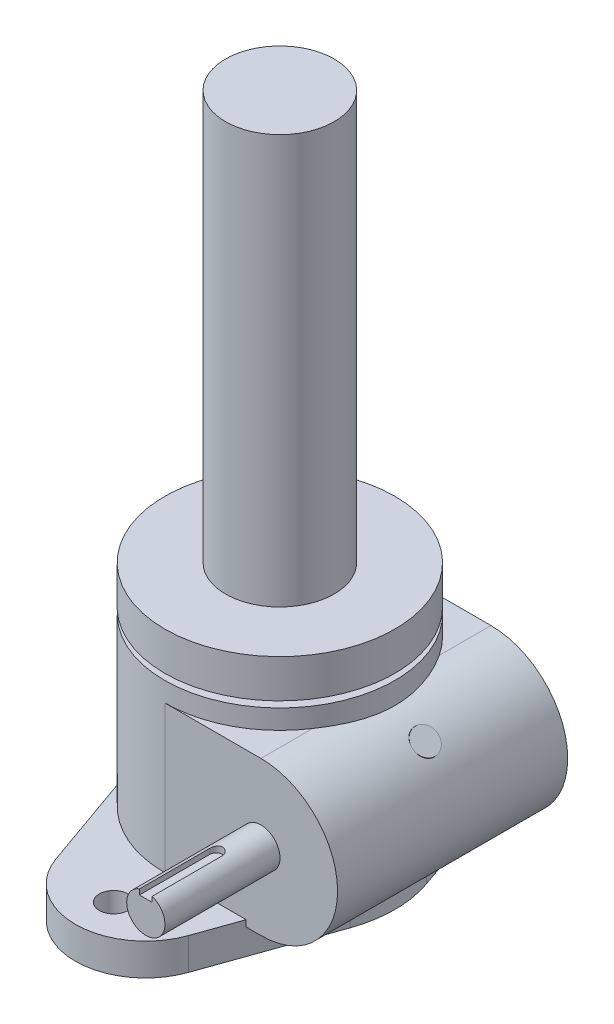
ISO-10303-21;
HEADER;
FILE_DESCRIPTION(('STEP AP214'),'2;1');
FILE_NAME('part.step','',(''),(''),'','','');
FILE_SCHEMA(('AUTOMOTIVE_DESIGN { 1 0 10303 214 1 1 1 1 }'));
ENDSEC;
DATA;
#1=APPLICATION_CONTEXT('core data for automotive mechanical design processes');
#2=APPLICATION_PROTOCOL_DEFINITION('international standard','automotive_design',2000,#1);
#3=PRODUCT_CONTEXT('',#1,'mechanical');
#4=PRODUCT('Part','Part','',(#3));
#5=PRODUCT_RELATED_PRODUCT_CATEGORY('part','',(#4));
#6=PRODUCT_DEFINITION_FORMATION('','',#4);
#7=PRODUCT_DEFINITION_CONTEXT('part definition',#1,'design');
#8=PRODUCT_DEFINITION('design','',#6,#7);
#9=PRODUCT_DEFINITION_SHAPE('','',#8);
#10=(LENGTH_UNIT() NAMED_UNIT(*) SI_UNIT(.MILLI.,.METRE.));
#11=(NAMED_UNIT(*) PLANE_ANGLE_UNIT() SI_UNIT($,.RADIAN.));
#12=(NAMED_UNIT(*) SI_UNIT($,.STERADIAN.) SOLID_ANGLE_UNIT());
#13=UNCERTAINTY_MEASURE_WITH_UNIT(LENGTH_MEASURE(1.E-05),#10,'distance_accuracy_value','');
#14=(GEOMETRIC_REPRESENTATION_CONTEXT(3) GLOBAL_UNCERTAINTY_ASSIGNED_CONTEXT((#13)) GLOBAL_UNIT_ASSIGNED_CONTEXT((#10,
#11,#12)) REPRESENTATION_CONTEXT('',''));
#15=CARTESIAN_POINT('',(0.,0.,0.));
#16=DIRECTION('',(0.,0.,1.));
#17=DIRECTION('',(1.,0.,0.));
#18=AXIS2_PLACEMENT_3D('',#15,#16,#17);
#19=CARTESIAN_POINT('',(23.8633,20.6502,57.15));
#20=DIRECTION('',(0.,0.,1.));
#21=DIRECTION('',(1.,0.,0.));
#22=AXIS2_PLACEMENT_3D('',#19,#20,#21);
#23=PLANE('',#22);
#24=DIRECTION('',(1.,0.,0.));
#25=VECTOR('',#24,1.);
#26=CARTESIAN_POINT('',(22.2758,28.5623,57.15));
#27=LINE('',#26,#25);
#28=CARTESIAN_POINT('',(22.2758,28.5623,57.15));
#29=VERTEX_POINT('',#28);
#30=CARTESIAN_POINT('',(25.4508,28.5623,57.15));
#31=VERTEX_POINT('',#30);
#32=EDGE_CURVE('E220',#29,#31,#27,.T.);
#33=ORIENTED_EDGE('',*,*,#32,.F.);
#34=DIRECTION('',(0.,-1.,0.));
#35=VECTOR('',#34,1.);
#36=CARTESIAN_POINT('',(22.2758,73.2750710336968,57.15));
#37=LINE('',#36,#35);
#38=CARTESIAN_POINT('',(22.2758,29.8766554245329,57.15));
#39=VERTEX_POINT('',#38);
#40=EDGE_CURVE('E218',#39,#29,#37,.T.);
#41=ORIENTED_EDGE('',*,*,#40,.F.);
#42=CARTESIAN_POINT('',(23.8633,25.4,57.15));
#43=DIRECTION('',(0.,0.,-1.));
#44=DIRECTION('',(-1.,0.,0.));
#45=AXIS2_PLACEMENT_3D('',#42,#43,#44);
#46=CIRCLE('',#45,4.74980000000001);
#47=CARTESIAN_POINT('',(25.4508,29.8766554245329,57.15));
#48=VERTEX_POINT('',#47);
#49=EDGE_CURVE('E356',#48,#39,#46,.T.);
#50=ORIENTED_EDGE('',*,*,#49,.F.);
#51=DIRECTION('',(0.,-1.,0.));
#52=VECTOR('',#51,1.);
#53=CARTESIAN_POINT('',(25.4508,73.2750710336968,57.15));
#54=LINE('',#53,#52);
#55=EDGE_CURVE('E225',#48,#31,#54,.T.);
#56=ORIENTED_EDGE('',*,*,#55,.T.);
#57=EDGE_LOOP('',(#33,#41,#50,#56));
#58=FACE_BOUND('',#57,.T.);
#59=ADVANCED_FACE('F31',(#58),#23,.T.);
#60=CARTESIAN_POINT('',(23.8633,25.4,-105.895333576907));
#61=DIRECTION('',(0.,0.,-1.));
#62=DIRECTION('',(-1.,0.,0.));
#63=AXIS2_PLACEMENT_3D('',#60,#61,#62);
#64=CYLINDRICAL_SURFACE('',#63,4.74980000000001);
#65=CARTESIAN_POINT('',(23.8633,25.4,28.575));
#66=DIRECTION('',(0.,0.,1.));
#67=DIRECTION('',(1.,0.,0.));
#68=AXIS2_PLACEMENT_3D('',#65,#66,#67);
#69=CIRCLE('',#68,4.74980000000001);
#70=CARTESIAN_POINT('',(28.6131,25.4,28.575));
#71=VERTEX_POINT('',#70);
#72=EDGE_CURVE('E360',#71,#71,#69,.T.);
#73=ORIENTED_EDGE('',*,*,#72,.T.);
#74=EDGE_LOOP('',(#73));
#75=FACE_BOUND('',#74,.T.);
#76=ORIENTED_EDGE('',*,*,#49,.T.);
#77=DIRECTION('',(0.,0.,-1.));
#78=VECTOR('',#77,1.);
#79=CARTESIAN_POINT('',(22.2758,29.8766554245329,-105.895333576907));
#80=LINE('',#79,#78);
#81=CARTESIAN_POINT('',(22.2758,29.8766554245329,39.6875));
#82=VERTEX_POINT('',#81);
#83=EDGE_CURVE('E11',#39,#82,#80,.T.);
#84=ORIENTED_EDGE('',*,*,#83,.T.);
#85=CARTESIAN_POINT('',(22.2758,29.8766554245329,39.6875));
#86=CARTESIAN_POINT('',(22.2757988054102,29.876651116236,39.6441836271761));
#87=CARTESIAN_POINT('',(22.2775740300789,29.8772849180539,39.6008893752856));
#88=CARTESIAN_POINT('',(22.2846463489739,29.8797850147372,39.5146368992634));
#89=CARTESIAN_POINT('',(22.2899424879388,29.881650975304,39.4716785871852));
#90=CARTESIAN_POINT('',(22.3110132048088,29.8890131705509,39.3440373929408));
#91=CARTESIAN_POINT('',(22.3319706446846,29.8962743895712,39.2602512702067));
#92=CARTESIAN_POINT('',(22.386949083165,29.9146223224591,39.0976526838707));
#93=CARTESIAN_POINT('',(22.4209627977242,29.9257069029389,39.0188374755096));
#94=CARTESIAN_POINT('',(22.5010183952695,29.9504439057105,38.867962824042));
#95=CARTESIAN_POINT('',(22.5470677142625,29.9640979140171,38.7959075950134));
#96=CARTESIAN_POINT('',(22.6518089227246,29.9930314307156,38.6578301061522));
#97=CARTESIAN_POINT('',(22.7108915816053,30.0083514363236,38.5921128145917));
#98=CARTESIAN_POINT('',(22.8391912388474,30.0385492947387,38.4713080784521));
#99=CARTESIAN_POINT('',(22.9084100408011,30.0534270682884,38.4162225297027));
#100=CARTESIAN_POINT('',(23.0572607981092,30.081535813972,38.3168541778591));
#101=CARTESIAN_POINT('',(23.1371184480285,30.0947132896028,38.2728929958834));
#102=CARTESIAN_POINT('',(23.3036082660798,30.1174559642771,38.1991507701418));
#103=CARTESIAN_POINT('',(23.390238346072,30.1270222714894,38.1693653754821));
#104=CARTESIAN_POINT('',(23.5646025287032,30.1411770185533,38.1258581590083));
#105=CARTESIAN_POINT('',(23.6521921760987,30.1459277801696,38.111611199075));
#106=CARTESIAN_POINT('',(23.8286407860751,30.1504925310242,38.0979151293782));
#107=CARTESIAN_POINT('',(23.9174994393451,30.1503077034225,38.0984624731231));
#108=CARTESIAN_POINT('',(24.0902426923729,30.1451317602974,38.1140075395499));
#109=CARTESIAN_POINT('',(24.1741852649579,30.1403304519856,38.1284346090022));
#110=CARTESIAN_POINT('',(24.3383799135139,30.1266996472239,38.1703853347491));
#111=CARTESIAN_POINT('',(24.4186317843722,30.1178699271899,38.1979097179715));
#112=CARTESIAN_POINT('',(24.5744134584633,30.0969331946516,38.2656056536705));
#113=CARTESIAN_POINT('',(24.6498670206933,30.0847844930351,38.3059392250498));
#114=CARTESIAN_POINT('',(24.793102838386,30.0584737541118,38.3979749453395));
#115=CARTESIAN_POINT('',(24.8608829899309,30.0443111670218,38.4496802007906));
#116=CARTESIAN_POINT('',(24.9902364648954,30.0146751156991,38.5658583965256));
#117=CARTESIAN_POINT('',(25.0513654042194,29.9991713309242,38.6308190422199));
#118=CARTESIAN_POINT('',(25.1620167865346,29.9691608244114,38.7702155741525));
#119=CARTESIAN_POINT('',(25.2115354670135,29.9546544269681,38.8446545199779));
#120=CARTESIAN_POINT('',(25.2981888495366,29.9281105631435,39.0023252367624));
#121=CARTESIAN_POINT('',(25.3351279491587,29.9161131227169,39.0856715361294));
#122=CARTESIAN_POINT('',(25.3942538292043,29.8964171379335,39.2578602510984));
#123=CARTESIAN_POINT('',(25.4164639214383,29.8887118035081,39.3466937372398));
#124=CARTESIAN_POINT('',(25.4375103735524,29.8813505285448,39.4782462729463));
#125=CARTESIAN_POINT('',(25.4424918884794,29.8795948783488,39.5199473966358));
#126=CARTESIAN_POINT('',(25.4491345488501,29.8772465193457,39.6035915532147));
#127=CARTESIAN_POINT('',(25.4507999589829,29.8766523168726,39.6455342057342));
#128=CARTESIAN_POINT('',(25.4508,29.8766554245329,39.6875));
#129=B_SPLINE_CURVE_WITH_KNOTS('',3,(#85,#86,#87,#88,#89,#90,#91,#92,#93,#94,#95,#96,#97,#98,
#99,#100,#101,#102,#103,#104,#105,#106,#107,#108,#109,#110,#111,#112,#113,#114,#115,#116,#117,
#118,#119,#120,#121,#122,#123,#124,#125,#126,#127,#128),.UNSPECIFIED.,.F.,.F.,(4,2,2,2,2,2,2,2,
2,2,2,2,2,2,2,2,2,2,2,2,2,4),(0.,0.129864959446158,0.259694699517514,0.518356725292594,
0.77687465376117,1.03555268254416,1.30341355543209,1.57132214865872,1.84626513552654,
2.12112368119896,2.3863739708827,2.65156067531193,2.90629063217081,3.16103472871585,
3.41913871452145,3.67731329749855,3.94768229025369,4.21813878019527,4.49262677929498,
4.76667929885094,4.89265618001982,5.01847094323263),.UNSPECIFIED.);
#130=CARTESIAN_POINT('',(25.4508,29.8766554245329,39.6875));
#131=VERTEX_POINT('',#130);
#132=EDGE_CURVE('E202',#82,#131,#129,.T.);
#133=ORIENTED_EDGE('',*,*,#132,.T.);
#134=DIRECTION('',(0.,0.,-1.));
#135=VECTOR('',#134,1.);
#136=CARTESIAN_POINT('',(25.4508,29.8766554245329,-105.895333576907));
#137=LINE('',#136,#135);
#138=EDGE_CURVE('E39',#131,#48,#137,.F.);
#139=ORIENTED_EDGE('',*,*,#138,.T.);
#140=EDGE_LOOP('',(#76,#84,#133,#139));
#141=FACE_BOUND('',#140,.T.);
#142=ADVANCED_FACE('F550',(#75,#141),#64,.T.);
#143=CARTESIAN_POINT('',(0.,-9.525,0.));
#144=DIRECTION('',(0.,1.,0.));
#145=DIRECTION('',(0.,0.,1.));
#146=AXIS2_PLACEMENT_3D('',#143,#144,#145);
#147=PLANE('',#146);
#148=CARTESIAN_POINT('',(0.,-9.525,0.));
#149=DIRECTION('',(0.,-1.,0.));
#150=DIRECTION('',(0.,0.,-1.));
#151=AXIS2_PLACEMENT_3D('',#148,#149,#150);
#152=CIRCLE('',#151,14.2875);
#153=CARTESIAN_POINT('',(0.,-9.525,-14.2875));
#154=VERTEX_POINT('',#153);
#155=EDGE_CURVE('E422',#154,#154,#152,.T.);
#156=ORIENTED_EDGE('',*,*,#155,.T.);
#157=EDGE_LOOP('',(#156));
#158=FACE_BOUND('',#157,.T.);
#159=CARTESIAN_POINT('',(0.,-9.525,0.));
#160=DIRECTION('',(0.,1.,0.));
#161=DIRECTION('',(0.,0.,1.));
#162=AXIS2_PLACEMENT_3D('',#159,#160,#161);
#163=CIRCLE('',#162,7.9375);
#164=CARTESIAN_POINT('',(0.,-9.525,7.9375));
#165=VERTEX_POINT('',#164);
#166=EDGE_CURVE('E239',#165,#165,#163,.F.);
#167=ORIENTED_EDGE('',*,*,#166,.F.);
#168=EDGE_LOOP('',(#167));
#169=FACE_BOUND('',#168,.T.);
#170=ADVANCED_FACE('F33',(#158,#169),#147,.F.);
#171=CARTESIAN_POINT('',(0.,0.,0.));
#172=DIRECTION('',(0.,-1.,0.));
#173=DIRECTION('',(0.,0.,-1.));
#174=AXIS2_PLACEMENT_3D('',#171,#172,#173);
#175=CYLINDRICAL_SURFACE('',#174,28.575);
#176=DIRECTION('',(0.,-1.,0.));
#177=VECTOR('',#176,1.);
#178=CARTESIAN_POINT('',(26.9407683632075,124.508004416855,-9.52500000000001));
#179=LINE('',#178,#177);
#180=CARTESIAN_POINT('',(26.9407683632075,6.60022105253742,-9.52500000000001));
#181=VERTEX_POINT('',#180);
#182=CARTESIAN_POINT('',(26.9407683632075,0.,-9.52500000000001));
#183=VERTEX_POINT('',#182);
#184=EDGE_CURVE('E296',#181,#183,#179,.T.);
#185=ORIENTED_EDGE('',*,*,#184,.F.);
#186=CARTESIAN_POINT('',(4.8133,25.4,28.1666960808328));
#187=CARTESIAN_POINT('',(4.81329492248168,24.8789057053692,28.1666907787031));
#188=CARTESIAN_POINT('',(4.8346892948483,24.3578908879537,28.1630643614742));
#189=CARTESIAN_POINT('',(4.9201037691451,23.3193094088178,28.1482711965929));
#190=CARTESIAN_POINT('',(4.984133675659,22.8017435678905,28.1371027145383));
#191=CARTESIAN_POINT('',(5.15443649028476,21.7733055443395,28.1064026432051));
#192=CARTESIAN_POINT('',(5.26075386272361,21.2624409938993,28.0868622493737));
#193=CARTESIAN_POINT('',(5.51478361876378,20.2516030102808,28.0380902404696));
#194=CARTESIAN_POINT('',(5.66249358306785,19.75162894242,28.008859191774));
#195=CARTESIAN_POINT('',(5.99823795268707,18.7657356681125,27.9388828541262));
#196=CARTESIAN_POINT('',(6.18630750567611,18.2798291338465,27.898127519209));
#197=CARTESIAN_POINT('',(6.60103950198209,17.3261391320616,27.8029160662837));
#198=CARTESIAN_POINT('',(6.82770262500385,16.8583559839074,27.7484597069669));
#199=CARTESIAN_POINT('',(7.31734659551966,15.9447151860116,27.6233750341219));
#200=CARTESIAN_POINT('',(7.58031105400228,15.4988477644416,27.5527540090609));
#201=CARTESIAN_POINT('',(8.13989262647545,14.6323207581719,27.3926524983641));
#202=CARTESIAN_POINT('',(8.43650849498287,14.2116602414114,27.3031727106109));
#203=CARTESIAN_POINT('',(9.05198817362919,13.4093130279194,27.1052370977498));
#204=CARTESIAN_POINT('',(9.37008384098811,13.026902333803,26.9973283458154));
#205=CARTESIAN_POINT('',(10.0312516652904,12.291940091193,26.7587009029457));
#206=CARTESIAN_POINT('',(10.374323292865,11.9393879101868,26.6279826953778));
#207=CARTESIAN_POINT('',(11.0809293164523,11.2666579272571,26.3417693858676));
#208=CARTESIAN_POINT('',(11.4444542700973,10.9464653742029,26.1862856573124));
#209=CARTESIAN_POINT('',(12.1872449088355,10.3400503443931,25.8489456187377));
#210=CARTESIAN_POINT('',(12.5665099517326,10.053826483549,25.667090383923));
#211=CARTESIAN_POINT('',(13.3155302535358,9.53037947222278,25.2862510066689));
#212=CARTESIAN_POINT('',(13.6847517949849,9.29138050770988,25.0886525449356));
#213=CARTESIAN_POINT('',(14.4281232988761,8.84500372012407,24.6686459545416));
#214=CARTESIAN_POINT('',(14.8022730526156,8.63762456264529,24.44623887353));
#215=CARTESIAN_POINT('',(15.551091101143,8.25395942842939,23.9768525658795));
#216=CARTESIAN_POINT('',(15.9257594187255,8.07767486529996,23.7298722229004));
#217=CARTESIAN_POINT('',(16.6714526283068,7.75503155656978,23.2120521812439));
#218=CARTESIAN_POINT('',(17.0424773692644,7.60867404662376,22.94121149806));
#219=CARTESIAN_POINT('',(17.787849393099,7.3402971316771,22.3685117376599));
#220=CARTESIAN_POINT('',(18.1619778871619,7.21911221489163,22.0659783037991));
#221=CARTESIAN_POINT('',(18.8988618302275,7.00423460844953,21.4382359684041));
#222=CARTESIAN_POINT('',(19.2616173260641,6.91054180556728,21.1130271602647));
#223=CARTESIAN_POINT('',(19.9730143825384,6.74788479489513,20.4413489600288));
#224=CARTESIAN_POINT('',(20.3216485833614,6.67893333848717,20.0948687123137));
#225=CARTESIAN_POINT('',(21.0022793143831,6.56290123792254,19.3824093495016));
#226=CARTESIAN_POINT('',(21.3342723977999,6.51582510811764,19.016426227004));
#227=CARTESIAN_POINT('',(22.128305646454,6.42323832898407,18.0939283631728));
#228=CARTESIAN_POINT('',(22.5798613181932,6.38842354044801,17.5272581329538));
#229=CARTESIAN_POINT('',(23.4390778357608,6.34986479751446,16.3604939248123));
#230=CARTESIAN_POINT('',(23.8467220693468,6.34613256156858,15.7603874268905));
#231=CARTESIAN_POINT('',(24.6156511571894,6.36097258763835,14.5302197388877));
#232=CARTESIAN_POINT('',(24.9768633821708,6.37957933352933,13.9001136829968));
#233=CARTESIAN_POINT('',(25.6500227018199,6.43097028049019,12.6148048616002));
#234=CARTESIAN_POINT('',(25.9619738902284,6.4637533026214,11.9596041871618));
#235=CARTESIAN_POINT('',(26.5397982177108,6.53667321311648,10.6166348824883));
#236=CARTESIAN_POINT('',(26.804819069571,6.57692330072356,9.92850589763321));
#237=CARTESIAN_POINT('',(27.2808965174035,6.65751202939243,8.5338306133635));
#238=CARTESIAN_POINT('',(27.4919526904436,6.69785067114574,7.82728416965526));
#239=CARTESIAN_POINT('',(27.8587317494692,6.77275961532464,6.40030285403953));
#240=CARTESIAN_POINT('',(28.01450212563,6.80733485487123,5.67988046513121));
#241=CARTESIAN_POINT('',(28.2699726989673,6.86622202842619,4.22872154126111));
#242=CARTESIAN_POINT('',(28.3696712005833,6.89053365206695,3.49798469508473));
#243=CARTESIAN_POINT('',(28.5184641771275,6.92735797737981,1.96705034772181));
#244=CARTESIAN_POINT('',(28.5624277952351,6.93866636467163,1.16631847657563));
#245=CARTESIAN_POINT('',(28.5829069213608,6.94389282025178,-0.436099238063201));
#246=CARTESIAN_POINT('',(28.5594182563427,6.9378098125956,-1.23778513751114));
#247=CARTESIAN_POINT('',(28.4451580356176,6.90912325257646,-2.83662060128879));
#248=CARTESIAN_POINT('',(28.354337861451,6.88650776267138,-3.6337664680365));
#249=CARTESIAN_POINT('',(28.106132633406,6.82805700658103,-5.21709628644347));
#250=CARTESIAN_POINT('',(27.9487488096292,6.79222198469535,-6.00328044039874));
#251=CARTESIAN_POINT('',(27.5727344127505,6.71367905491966,-7.5424825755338));
#252=CARTESIAN_POINT('',(27.3554968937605,6.67113591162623,-8.29585018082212));
#253=CARTESIAN_POINT('',(26.8598700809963,6.5854771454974,-9.78221619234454));
#254=CARTESIAN_POINT('',(26.5814772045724,6.54236148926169,-10.5152134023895));
#255=CARTESIAN_POINT('',(25.9653064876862,6.46377883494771,-11.956057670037));
#256=CARTESIAN_POINT('',(25.6275417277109,6.42831015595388,-12.6639102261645));
#257=CARTESIAN_POINT('',(24.8946713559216,6.37439326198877,-14.0499155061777));
#258=CARTESIAN_POINT('',(24.4995777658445,6.35594148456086,-14.7280744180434));
#259=CARTESIAN_POINT('',(23.7356306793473,6.34736729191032,-15.9233460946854));
#260=CARTESIAN_POINT('',(23.3762002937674,6.35250343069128,-16.4464618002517));
#261=CARTESIAN_POINT('',(22.6236758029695,6.38664496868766,-17.4671622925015));
#262=CARTESIAN_POINT('',(22.2305835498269,6.4156490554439,-17.964748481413));
#263=CARTESIAN_POINT('',(21.4141423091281,6.5036394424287,-18.9305141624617));
#264=CARTESIAN_POINT('',(20.9908375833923,6.56258262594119,-19.3987348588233));
#265=CARTESIAN_POINT('',(20.1173772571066,6.71666341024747,-20.3031186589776));
#266=CARTESIAN_POINT('',(19.6672270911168,6.81179370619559,-20.7392882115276));
#267=CARTESIAN_POINT('',(18.8305740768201,7.02272257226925,-21.4987864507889));
#268=CARTESIAN_POINT('',(18.4476853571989,7.13145118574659,-21.8280710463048));
#269=CARTESIAN_POINT('',(17.6711499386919,7.37984811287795,-22.4613434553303));
#270=CARTESIAN_POINT('',(17.27750443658,7.51951299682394,-22.7653340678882));
#271=CARTESIAN_POINT('',(16.4838637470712,7.83218238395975,-23.3464054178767));
#272=CARTESIAN_POINT('',(16.0838712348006,8.00517316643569,-23.6234971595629));
#273=CARTESIAN_POINT('',(15.2822497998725,8.38632892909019,-24.1498107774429));
#274=CARTESIAN_POINT('',(14.880620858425,8.59449431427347,-24.399032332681));
#275=CARTESIAN_POINT('',(14.0792826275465,9.04798608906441,-24.870090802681));
#276=CARTESIAN_POINT('',(13.6795898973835,9.29347413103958,-25.0918005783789));
#277=CARTESIAN_POINT('',(12.8895712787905,9.820996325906,-25.5066398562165));
#278=CARTESIAN_POINT('',(12.4992454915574,10.1030308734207,-25.6997690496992));
#279=CARTESIAN_POINT('',(11.7335035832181,10.7028202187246,-26.0582870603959));
#280=CARTESIAN_POINT('',(11.3580892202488,11.0205792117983,-26.2236726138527));
#281=CARTESIAN_POINT('',(10.6274951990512,11.690096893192,-26.5281669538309));
#282=CARTESIAN_POINT('',(10.2723146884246,12.0418541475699,-26.6672768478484));
#283=CARTESIAN_POINT('',(9.6120626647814,12.7500320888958,-26.9119611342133));
#284=CARTESIAN_POINT('',(9.30522645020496,13.1042226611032,-27.0192458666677));
#285=CARTESIAN_POINT('',(8.71630061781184,13.8374739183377,-27.2149413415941));
#286=CARTESIAN_POINT('',(8.43420960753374,14.2165332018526,-27.3033531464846));
#287=CARTESIAN_POINT('',(7.89754368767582,14.9970451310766,-27.4633916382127));
#288=CARTESIAN_POINT('',(7.64297130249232,15.3984998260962,-27.5350167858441));
#289=CARTESIAN_POINT('',(7.16368865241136,16.2211053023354,-27.6635821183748));
#290=CARTESIAN_POINT('',(6.93897961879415,16.6422568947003,-27.720521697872));
#291=CARTESIAN_POINT('',(6.51442857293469,17.5156707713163,-27.8234101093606));
#292=CARTESIAN_POINT('',(6.31565212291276,17.9685010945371,-27.8689341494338));
#293=CARTESIAN_POINT('',(5.953647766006,18.8891221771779,-27.9485073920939));
#294=CARTESIAN_POINT('',(5.79042035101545,19.3569131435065,-27.9825564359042));
#295=CARTESIAN_POINT('',(5.500755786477,20.304420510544,-28.0409372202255));
#296=CARTESIAN_POINT('',(5.37432467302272,20.7841388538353,-28.0652673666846));
#297=CARTESIAN_POINT('',(5.15921478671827,21.7523118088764,-28.1056062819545));
#298=CARTESIAN_POINT('',(5.07053701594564,22.2407666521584,-28.1216148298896));
#299=CARTESIAN_POINT('',(4.92822160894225,23.246931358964,-28.1469140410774));
#300=CARTESIAN_POINT('',(4.87647398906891,23.7649185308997,-28.155844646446));
#301=CARTESIAN_POINT('',(4.81553748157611,24.8034732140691,-28.16633050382));
#302=CARTESIAN_POINT('',(4.80634997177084,25.3240408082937,-28.1678855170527));
#303=CARTESIAN_POINT('',(4.83060634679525,26.3642408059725,-28.1637359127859));
#304=CARTESIAN_POINT('',(4.86405719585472,26.8838730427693,-28.1580301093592));
#305=CARTESIAN_POINT('',(4.97335091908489,27.9185185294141,-28.1389316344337));
#306=CARTESIAN_POINT('',(5.04919383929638,28.4335317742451,-28.1255389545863));
#307=CARTESIAN_POINT('',(5.2440457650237,29.4624940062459,-28.089865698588));
#308=CARTESIAN_POINT('',(5.36364323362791,29.9763275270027,-28.0674635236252));
#309=CARTESIAN_POINT('',(5.64485529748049,30.991810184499,-28.0122606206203));
#310=CARTESIAN_POINT('',(5.8064705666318,31.4934591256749,-27.9794597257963));
#311=CARTESIAN_POINT('',(6.17032462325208,32.4808133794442,-27.9014750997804));
#312=CARTESIAN_POINT('',(6.37256274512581,32.9665189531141,-27.8562915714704));
#313=CARTESIAN_POINT('',(6.81579839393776,33.9182582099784,-27.7511686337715));
#314=CARTESIAN_POINT('',(7.0567950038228,34.3842923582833,-27.6912295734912));
#315=CARTESIAN_POINT('',(7.57076937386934,35.2853636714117,-27.5550995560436));
#316=CARTESIAN_POINT('',(7.84314044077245,35.7207905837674,-27.479199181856));
#317=CARTESIAN_POINT('',(8.42013308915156,36.5656955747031,-27.3079200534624));
#318=CARTESIAN_POINT('',(8.72475431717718,36.9751739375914,-27.2125415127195));
#319=CARTESIAN_POINT('',(9.36254098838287,37.7647846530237,-26.9997472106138));
#320=CARTESIAN_POINT('',(9.6956906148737,38.1449330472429,-26.882343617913));
#321=CARTESIAN_POINT('',(10.3864769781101,38.8732926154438,-26.6230677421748));
#322=CARTESIAN_POINT('',(10.7441123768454,39.2215055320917,-26.4811967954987));
#323=CARTESIAN_POINT('',(11.4598096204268,39.8663641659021,-26.1791183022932));
#324=CARTESIAN_POINT('',(11.8168699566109,40.1647547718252,-26.0202586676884));
#325=CARTESIAN_POINT('',(12.5441356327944,40.7294140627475,-25.6775546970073));
#326=CARTESIAN_POINT('',(12.9143403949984,40.9956841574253,-25.4937114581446));
#327=CARTESIAN_POINT('',(13.6630743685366,41.4953550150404,-25.1003941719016));
#328=CARTESIAN_POINT('',(14.041601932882,41.7287622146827,-24.8909251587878));
#329=CARTESIAN_POINT('',(14.80226655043,42.1628145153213,-24.4462185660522));
#330=CARTESIAN_POINT('',(15.1844036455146,42.3634592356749,-24.2109806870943));
#331=CARTESIAN_POINT('',(15.9405368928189,42.7293237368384,-23.7198094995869));
#332=CARTESIAN_POINT('',(16.3145519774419,42.895134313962,-23.4643438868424));
#333=CARTESIAN_POINT('',(17.0575562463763,43.1973374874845,-22.9298895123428));
#334=CARTESIAN_POINT('',(17.4265456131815,43.3337311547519,-22.650901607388));
#335=CARTESIAN_POINT('',(18.1560895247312,43.5790659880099,-22.0704420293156));
#336=CARTESIAN_POINT('',(18.516640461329,43.6879955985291,-21.7689609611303));
#337=CARTESIAN_POINT('',(19.226132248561,43.8806485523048,-21.1449716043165));
#338=CARTESIAN_POINT('',(19.5750707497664,43.9643668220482,-20.8224590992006));
#339=CARTESIAN_POINT('',(20.3877570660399,44.1364536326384,-20.0324920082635));
#340=CARTESIAN_POINT('',(20.8451596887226,44.2146631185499,-19.5562551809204));
#341=CARTESIAN_POINT('',(21.72787957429,44.335182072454,-18.5706228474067));
#342=CARTESIAN_POINT('',(22.1531862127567,44.3774796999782,-18.0612164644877));
#343=CARTESIAN_POINT('',(22.9684988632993,44.4333663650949,-17.0123638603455));
#344=CARTESIAN_POINT('',(23.3584549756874,44.4469154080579,-16.472876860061));
#345=CARTESIAN_POINT('',(24.0997319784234,44.4521391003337,-15.3680243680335));
#346=CARTESIAN_POINT('',(24.4510551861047,44.443815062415,-14.8026604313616));
#347=CARTESIAN_POINT('',(25.1192901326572,44.4115477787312,-13.6385687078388));
#348=CARTESIAN_POINT('',(25.435451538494,44.3873205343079,-13.0394189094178));
#349=CARTESIAN_POINT('',(26.0242651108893,44.329349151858,-11.820590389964));
#350=CARTESIAN_POINT('',(26.2969172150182,44.2956050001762,-11.2009116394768));
#351=CARTESIAN_POINT('',(26.797438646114,44.2243790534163,-9.94410847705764));
#352=CARTESIAN_POINT('',(27.0253186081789,44.1868981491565,-9.3069882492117));
#353=CARTESIAN_POINT('',(27.4353490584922,44.1132662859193,-8.01808541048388));
#354=CARTESIAN_POINT('',(27.6174956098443,44.0771154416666,-7.36630154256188));
#355=CARTESIAN_POINT('',(27.9639000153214,44.0044232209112,-5.93204044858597));
#356=CARTESIAN_POINT('',(28.1189518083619,43.9689956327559,-5.14726195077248));
#357=CARTESIAN_POINT('',(28.362774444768,43.9114272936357,-3.56692759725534));
#358=CARTESIAN_POINT('',(28.4515393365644,43.8892877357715,-2.77137078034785));
#359=CARTESIAN_POINT('',(28.5620161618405,43.8615235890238,-1.17539871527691));
#360=CARTESIAN_POINT('',(28.5837359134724,43.8558970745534,-0.374984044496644));
#361=CARTESIAN_POINT('',(28.5599461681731,43.8619653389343,1.22474763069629));
#362=CARTESIAN_POINT('',(28.5144392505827,43.8736594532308,2.0240646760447));
#363=CARTESIAN_POINT('',(28.3581669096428,43.9122916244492,3.59993884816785));
#364=CARTESIAN_POINT('',(28.2487078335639,43.9389241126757,4.37663373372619));
#365=CARTESIAN_POINT('',(27.9664514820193,44.0034285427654,5.91794557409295));
#366=CARTESIAN_POINT('',(27.7936531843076,44.0413006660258,6.68256233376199));
#367=CARTESIAN_POINT('',(27.3856668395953,44.1226788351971,8.1957824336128));
#368=CARTESIAN_POINT('',(27.1503924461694,44.1661926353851,8.94436204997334));
#369=CARTESIAN_POINT('',(26.6190580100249,44.2515419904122,10.4197464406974));
#370=CARTESIAN_POINT('',(26.3229973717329,44.2933775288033,11.1465510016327));
#371=CARTESIAN_POINT('',(25.6638404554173,44.3676900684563,12.5914264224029));
#372=CARTESIAN_POINT('',(25.299269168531,44.3999104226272,13.3088382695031));
#373=CARTESIAN_POINT('',(24.5104027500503,44.4431022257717,14.7111382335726));
#374=CARTESIAN_POINT('',(24.0860985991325,44.4540704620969,15.3960214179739));
#375=CARTESIAN_POINT('',(23.4081460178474,44.445897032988,16.3936197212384));
#376=CARTESIAN_POINT('',(23.1754983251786,44.4390872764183,16.7208865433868));
#377=CARTESIAN_POINT('',(22.6967877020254,44.4157615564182,17.3651204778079));
#378=CARTESIAN_POINT('',(22.4507255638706,44.3992461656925,17.68208819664));
#379=CARTESIAN_POINT('',(21.946022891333,44.3549642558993,18.3047319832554));
#380=CARTESIAN_POINT('',(21.6873899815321,44.3272044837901,18.610414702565));
#381=CARTESIAN_POINT('',(21.1582053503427,44.2588484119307,19.2099166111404));
#382=CARTESIAN_POINT('',(20.8876509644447,44.2182492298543,19.5037331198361));
#383=CARTESIAN_POINT('',(20.2424044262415,44.1064697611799,20.1757208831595));
#384=CARTESIAN_POINT('',(19.8634082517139,44.0295918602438,20.5488585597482));
#385=CARTESIAN_POINT('',(19.0891674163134,43.8463639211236,21.2700289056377));
#386=CARTESIAN_POINT('',(18.6939274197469,43.7400222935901,21.6180687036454));
#387=CARTESIAN_POINT('',(17.8911951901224,43.4945420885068,22.2869572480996));
#388=CARTESIAN_POINT('',(17.4837111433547,43.3554250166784,22.607823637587));
#389=CARTESIAN_POINT('',(16.6608975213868,43.0414780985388,23.2208595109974));
#390=CARTESIAN_POINT('',(16.2455677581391,42.8666473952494,23.5130283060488));
#391=CARTESIAN_POINT('',(15.4096732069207,42.4778373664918,24.0691976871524));
#392=CARTESIAN_POINT('',(14.9890919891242,42.2636035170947,24.3329963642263));
#393=CARTESIAN_POINT('',(14.1515366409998,41.7955556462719,24.8294513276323));
#394=CARTESIAN_POINT('',(13.7345625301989,41.5417414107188,25.0621074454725));
#395=CARTESIAN_POINT('',(12.9106475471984,40.9944366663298,25.4963268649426));
#396=CARTESIAN_POINT('',(12.5037054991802,40.7009508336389,25.6978938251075));
#397=CARTESIAN_POINT('',(11.7061396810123,40.0752437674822,26.0708795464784));
#398=CARTESIAN_POINT('',(11.3155146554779,39.7430255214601,26.242300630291));
#399=CARTESIAN_POINT('',(10.5954195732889,39.0777556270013,26.5406057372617));
#400=CARTESIAN_POINT('',(10.2637837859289,38.7482748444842,26.6702531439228));
#401=CARTESIAN_POINT('',(9.62230659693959,38.0616468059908,26.9083424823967));
#402=CARTESIAN_POINT('',(9.31246359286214,37.7045015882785,27.0167859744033));
#403=CARTESIAN_POINT('',(8.71785842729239,36.9647479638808,27.2144779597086));
#404=CARTESIAN_POINT('',(8.43310419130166,36.5821315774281,27.3037204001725));
#405=CARTESIAN_POINT('',(7.89166001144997,35.7941217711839,27.4651080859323));
#406=CARTESIAN_POINT('',(7.63497070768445,35.388727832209,27.5372529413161));
#407=CARTESIAN_POINT('',(7.14958087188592,34.5536719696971,27.6672717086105));
#408=CARTESIAN_POINT('',(6.92119357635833,34.123804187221,27.7249920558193));
#409=CARTESIAN_POINT('',(6.49749150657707,33.2465601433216,27.8273381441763));
#410=CARTESIAN_POINT('',(6.30217836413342,32.7991830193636,27.8719632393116));
#411=CARTESIAN_POINT('',(5.94634635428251,31.8902436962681,27.9500408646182));
#412=CARTESIAN_POINT('',(5.78580139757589,31.4286924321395,27.9835017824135));
#413=CARTESIAN_POINT('',(5.50055919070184,30.4942096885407,28.0409622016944));
#414=CARTESIAN_POINT('',(5.37585577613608,30.0212801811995,28.0649633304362));
#415=CARTESIAN_POINT('',(5.11816154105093,28.8649632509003,28.1133286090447));
#416=CARTESIAN_POINT('',(5.0039560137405,28.1771296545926,28.1335563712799));
#417=CARTESIAN_POINT('',(4.85152643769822,26.7928170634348,28.1602440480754));
#418=CARTESIAN_POINT('',(4.81330678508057,26.0963375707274,28.1667031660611));
#419=CARTESIAN_POINT('',(4.8133,25.4,28.1666960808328));
#420=B_SPLINE_CURVE_WITH_KNOTS('',3,(#186,#187,#188,#189,#190,#191,#192,#193,#194,#195,#196,
#197,#198,#199,#200,#201,#202,#203,#204,#205,#206,#207,#208,#209,#210,#211,#212,#213,#214,#215,
#216,#217,#218,#219,#220,#221,#222,#223,#224,#225,#226,#227,#228,#229,#230,#231,#232,#233,#234,
#235,#236,#237,#238,#239,#240,#241,#242,#243,#244,#245,#246,#247,#248,#249,#250,#251,#252,#253,
#254,#255,#256,#257,#258,#259,#260,#261,#262,#263,#264,#265,#266,#267,#268,#269,#270,#271,#272,
#273,#274,#275,#276,#277,#278,#279,#280,#281,#282,#283,#284,#285,#286,#287,#288,#289,#290,#291,
#292,#293,#294,#295,#296,#297,#298,#299,#300,#301,#302,#303,#304,#305,#306,#307,#308,#309,#310,
#311,#312,#313,#314,#315,#316,#317,#318,#319,#320,#321,#322,#323,#324,#325,#326,#327,#328,#329,
#330,#331,#332,#333,#334,#335,#336,#337,#338,#339,#340,#341,#342,#343,#344,#345,#346,#347,#348,
#349,#350,#351,#352,#353,#354,#355,#356,#357,#358,#359,#360,#361,#362,#363,#364,#365,#366,#367,
#368,#369,#370,#371,#372,#373,#374,#375,#376,#377,#378,#379,#380,#381,#382,#383,#384,#385,#386,
#387,#388,#389,#390,#391,#392,#393,#394,#395,#396,#397,#398,#399,#400,#401,#402,#403,#404,#405,
#406,#407,#408,#409,#410,#411,#412,#413,#414,#415,#416,#417,#418,#419),.UNSPECIFIED.,.T.,.F.,(4,
2,2,2,2,2,2,2,2,2,2,2,2,2,2,2,2,2,2,2,2,2,2,2,2,2,2,2,2,2,2,2,2,2,2,2,2,2,2,2,2,2,2,2,2,2,2,2,2,
2,2,2,2,2,2,2,2,2,2,2,2,2,2,2,2,2,2,2,2,2,2,2,2,2,2,2,2,2,2,2,2,2,2,2,2,2,2,2,2,2,2,2,2,2,2,2,2,
2,2,2,2,2,2,2,2,2,2,2,2,2,2,2,2,2,2,2,4),(0.,1.56269393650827,3.12574735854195,4.69044865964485,
6.25505852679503,7.82103652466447,9.38704210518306,10.9523429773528,12.5175859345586,
14.0425829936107,15.5675477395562,17.0918141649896,18.6160184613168,20.060827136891,
21.5055748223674,22.9503881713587,24.3952611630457,25.8822816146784,27.3692959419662,
28.857075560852,30.345162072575,32.5182467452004,34.6921506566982,36.8694146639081,
39.0464976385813,41.259775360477,43.4730704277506,45.6844596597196,47.8959157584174,
50.2989117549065,52.7020564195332,55.1069380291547,57.5117751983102,59.8647846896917,
62.2179320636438,64.5705616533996,66.9226986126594,68.8251709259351,70.7275386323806,
72.6271743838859,74.5264268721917,76.0746409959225,77.6226835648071,79.1700901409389,
80.7175145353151,82.2718428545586,83.8261879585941,85.3807157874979,86.9351780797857,
88.3757444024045,89.8162296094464,91.2568468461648,92.6975234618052,94.185751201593,
95.6739995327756,97.1624918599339,98.6510236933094,100.211134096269,101.771295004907,
103.331710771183,104.892128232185,106.474353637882,108.056604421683,109.638829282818,
111.221016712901,112.776568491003,114.332103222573,115.886781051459,117.441373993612,
118.914621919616,120.387805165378,121.860699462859,123.33361087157,124.77905722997,
126.224450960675,127.670451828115,129.116743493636,131.108618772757,133.101150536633,
135.096452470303,137.091634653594,139.123453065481,141.155274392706,143.186612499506,
145.218125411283,147.617364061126,150.016818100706,152.41599232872,154.815074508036,
157.16678407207,159.518531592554,161.873546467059,164.22858441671,166.641785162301,
169.055350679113,170.259734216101,171.464046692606,172.66763761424,173.87149892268,
175.482040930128,177.092123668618,178.701152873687,180.310220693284,181.930072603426,
183.549933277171,185.16960318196,186.789148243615,188.242805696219,189.696356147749,
191.150364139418,192.604405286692,194.073323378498,195.542313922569,197.010198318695,
198.477830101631,200.565935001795,202.654160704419),.UNSPECIFIED.);
#421=CARTESIAN_POINT('',(26.9407683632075,6.60022105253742,9.525));
#422=VERTEX_POINT('',#421);
#423=EDGE_CURVE('E425',#422,#181,#420,.T.);
#424=ORIENTED_EDGE('',*,*,#423,.F.);
#425=DIRECTION('',(0.,-1.,0.));
#426=VECTOR('',#425,1.);
#427=CARTESIAN_POINT('',(26.9407683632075,124.508004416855,9.525));
#428=LINE('',#427,#426);
#429=CARTESIAN_POINT('',(26.9407683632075,0.,9.52500000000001));
#430=VERTEX_POINT('',#429);
#431=EDGE_CURVE('E298',#422,#430,#428,.T.);
#432=ORIENTED_EDGE('',*,*,#431,.T.);
#433=CARTESIAN_POINT('',(0.,0.,0.));
#434=DIRECTION('',(0.,-1.,0.));
#435=DIRECTION('',(0.,0.,-1.));
#436=AXIS2_PLACEMENT_3D('',#433,#434,#435);
#437=CIRCLE('',#436,28.575);
#438=EDGE_CURVE('E416',#183,#430,#437,.T.);
#439=ORIENTED_EDGE('',*,*,#438,.F.);
#440=EDGE_LOOP('',(#185,#424,#432,#439));
#441=FACE_BOUND('',#440,.T.);
#442=ADVANCED_FACE('F445',(#441),#175,.T.);
#443=CARTESIAN_POINT('',(23.8633,25.4,85.9610724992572));
#444=DIRECTION('',(0.,0.,-1.));
#445=DIRECTION('',(-1.,0.,0.));
#446=AXIS2_PLACEMENT_3D('',#443,#444,#445);
#447=CYLINDRICAL_SURFACE('',#446,19.05);
#448=CARTESIAN_POINT('',(38.3693264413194,37.7481859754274,0.));
#449=CARTESIAN_POINT('',(38.3693230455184,37.7481929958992,0.1770072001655));
#450=CARTESIAN_POINT('',(38.3595745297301,37.7596703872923,0.354111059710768));
#451=CARTESIAN_POINT('',(38.3207193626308,37.8050951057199,0.703349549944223));
#452=CARTESIAN_POINT('',(38.2915948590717,37.8390631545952,0.875479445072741));
#453=CARTESIAN_POINT('',(38.2144932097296,37.927936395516,1.20966519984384));
#454=CARTESIAN_POINT('',(38.1665318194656,37.9828240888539,1.37172934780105));
#455=CARTESIAN_POINT('',(38.0525520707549,38.1112139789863,1.68145581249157));
#456=CARTESIAN_POINT('',(37.9865357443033,38.1847140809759,1.82911974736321));
#457=CARTESIAN_POINT('',(37.8368789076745,38.3481249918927,2.10732731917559));
#458=CARTESIAN_POINT('',(37.7530880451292,38.4381748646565,2.23770841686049));
#459=CARTESIAN_POINT('',(37.5697235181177,38.6308012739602,2.47623749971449));
#460=CARTESIAN_POINT('',(37.470148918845,38.7333785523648,2.58438416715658));
#461=CARTESIAN_POINT('',(37.2565144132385,38.947964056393,2.77598450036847));
#462=CARTESIAN_POINT('',(37.1423715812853,39.0600249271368,2.85928689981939));
#463=CARTESIAN_POINT('',(36.9025994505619,39.2890829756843,2.9978617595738));
#464=CARTESIAN_POINT('',(36.7769708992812,39.406079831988,3.05313604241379));
#465=CARTESIAN_POINT('',(36.5185542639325,39.6399830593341,3.13358851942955));
#466=CARTESIAN_POINT('',(36.3858429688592,39.7568802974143,3.15903980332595));
#467=CARTESIAN_POINT('',(36.1158186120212,39.9880039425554,3.17997300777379));
#468=CARTESIAN_POINT('',(35.978505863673,40.1022305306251,3.17545696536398));
#469=CARTESIAN_POINT('',(35.70466950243,40.3236449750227,3.13679668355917));
#470=CARTESIAN_POINT('',(35.5681515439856,40.4308913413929,3.10294634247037));
#471=CARTESIAN_POINT('',(35.2986793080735,40.6369086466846,3.00704113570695));
#472=CARTESIAN_POINT('',(35.1657251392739,40.7356793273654,2.94498541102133));
#473=CARTESIAN_POINT('',(34.9069608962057,40.9230704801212,2.79413888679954));
#474=CARTESIAN_POINT('',(34.7811863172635,41.0116424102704,2.7052269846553));
#475=CARTESIAN_POINT('',(34.5415300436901,41.176536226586,2.50328071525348));
#476=CARTESIAN_POINT('',(34.4276493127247,41.252857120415,2.39024439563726));
#477=CARTESIAN_POINT('',(34.2143321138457,41.3929718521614,2.14162791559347));
#478=CARTESIAN_POINT('',(34.1150876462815,41.4566024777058,2.00579088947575));
#479=CARTESIAN_POINT('',(33.9362997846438,41.5693655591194,1.71629439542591));
#480=CARTESIAN_POINT('',(33.8567565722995,41.6184978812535,1.56263476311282));
#481=CARTESIAN_POINT('',(33.7203264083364,41.7017777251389,1.2415626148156));
#482=CARTESIAN_POINT('',(33.6634649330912,41.735908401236,1.07413488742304));
#483=CARTESIAN_POINT('',(33.5748289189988,41.7887581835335,0.730441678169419));
#484=CARTESIAN_POINT('',(33.5430521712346,41.8074786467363,0.554176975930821));
#485=CARTESIAN_POINT('',(33.5061385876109,41.8292003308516,0.200067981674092));
#486=CARTESIAN_POINT('',(33.5006881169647,41.8323866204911,0.0222676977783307));
#487=CARTESIAN_POINT('',(33.5158040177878,41.8235118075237,-0.33183407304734));
#488=CARTESIAN_POINT('',(33.5363693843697,41.8114512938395,-0.508135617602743));
#489=CARTESIAN_POINT('',(33.6024473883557,41.7723227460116,-0.853094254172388));
#490=CARTESIAN_POINT('',(33.6478013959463,41.7453501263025,-1.02179264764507));
#491=CARTESIAN_POINT('',(33.7615467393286,41.6767194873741,-1.34806711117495));
#492=CARTESIAN_POINT('',(33.8299394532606,41.6350605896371,-1.50564251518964));
#493=CARTESIAN_POINT('',(33.98790677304,41.5370234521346,-1.80679673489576));
#494=CARTESIAN_POINT('',(34.0776709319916,41.4805129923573,-1.95023304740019));
#495=CARTESIAN_POINT('',(34.2747716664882,41.3536034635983,-2.21756418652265));
#496=CARTESIAN_POINT('',(34.3821094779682,41.2832034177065,-2.34145763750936));
#497=CARTESIAN_POINT('',(34.6118351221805,41.1286623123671,-2.56749790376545));
#498=CARTESIAN_POINT('',(34.7343678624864,41.0443859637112,-2.66940515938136));
#499=CARTESIAN_POINT('',(34.9894135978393,40.8640374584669,-2.84690226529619));
#500=CARTESIAN_POINT('',(35.1219262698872,40.7679656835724,-2.92249296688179));
#501=CARTESIAN_POINT('',(35.3919683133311,40.5664281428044,-3.04483844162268));
#502=CARTESIAN_POINT('',(35.5294730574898,40.4610055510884,-3.09171857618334));
#503=CARTESIAN_POINT('',(35.8056783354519,40.2429457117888,-3.15571581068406));
#504=CARTESIAN_POINT('',(35.9443787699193,40.1303090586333,-3.17283535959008));
#505=CARTESIAN_POINT('',(36.2171079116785,39.9023151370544,-3.17675499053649));
#506=CARTESIAN_POINT('',(36.3511728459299,39.7870073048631,-3.16391957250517));
#507=CARTESIAN_POINT('',(36.612659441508,39.5558045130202,-3.10908201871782));
#508=CARTESIAN_POINT('',(36.7400811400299,39.4399095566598,-3.06708004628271));
#509=CARTESIAN_POINT('',(36.9849270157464,39.2113520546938,-2.95524152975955));
#510=CARTESIAN_POINT('',(37.1023621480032,39.098686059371,-2.88543597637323));
#511=CARTESIAN_POINT('',(37.3247580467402,38.8802068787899,-2.72001242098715));
#512=CARTESIAN_POINT('',(37.4297182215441,38.7743940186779,-2.62439319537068));
#513=CARTESIAN_POINT('',(37.6261856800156,38.5721528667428,-2.40876443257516));
#514=CARTESIAN_POINT('',(37.7175250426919,38.475845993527,-2.2884879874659));
#515=CARTESIAN_POINT('',(37.8836278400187,38.2975885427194,-2.02751904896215));
#516=CARTESIAN_POINT('',(37.958387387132,38.2156413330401,-1.88682178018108));
#517=CARTESIAN_POINT('',(38.0904861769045,38.0688406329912,-1.58782344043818));
#518=CARTESIAN_POINT('',(38.1476984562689,38.004112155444,-1.42940488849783));
#519=CARTESIAN_POINT('',(38.2429673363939,37.8953167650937,-1.10031627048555));
#520=CARTESIAN_POINT('',(38.281043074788,37.8512292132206,-0.929658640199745));
#521=CARTESIAN_POINT('',(38.3292236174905,37.7951787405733,-0.631947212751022));
#522=CARTESIAN_POINT('',(38.344247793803,37.7775963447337,-0.506695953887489));
#523=CARTESIAN_POINT('',(38.364300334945,37.7540975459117,-0.25431307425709));
#524=CARTESIAN_POINT('',(38.3693288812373,37.7481809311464,-0.127181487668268));
#525=CARTESIAN_POINT('',(38.3693264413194,37.7481859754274,0.));
#526=B_SPLINE_CURVE_WITH_KNOTS('',3,(#448,#449,#450,#451,#452,#453,#454,#455,#456,#457,#458,
#459,#460,#461,#462,#463,#464,#465,#466,#467,#468,#469,#470,#471,#472,#473,#474,#475,#476,#477,
#478,#479,#480,#481,#482,#483,#484,#485,#486,#487,#488,#489,#490,#491,#492,#493,#494,#495,#496,
#497,#498,#499,#500,#501,#502,#503,#504,#505,#506,#507,#508,#509,#510,#511,#512,#513,#514,#515,
#516,#517,#518,#519,#520,#521,#522,#523,#524,#525),.UNSPECIFIED.,.T.,.F.,(4,2,2,2,2,2,2,2,2,2,2,
2,2,2,2,2,2,2,2,2,2,2,2,2,2,2,2,2,2,2,2,2,2,2,2,2,2,2,4),(0.,0.530556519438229,1.06160255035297,
1.59220534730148,2.12274845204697,2.65797232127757,3.19322790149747,3.73167884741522,
4.27009477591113,4.80354090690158,5.33695077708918,5.86507743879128,6.39322018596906,
6.92378097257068,7.45438471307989,7.99142576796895,8.52847177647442,9.06611931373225,
9.60371950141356,10.1348989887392,10.6660579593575,11.1938570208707,11.7216876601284,
12.2543867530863,12.7871233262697,13.3254002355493,13.863659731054,14.3995519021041,
14.9353999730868,15.4647617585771,15.994120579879,16.5228910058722,17.0516865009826,
17.5865408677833,18.121520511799,18.6602843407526,19.1985082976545,19.5797255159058,
19.9609358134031),.UNSPECIFIED.);
#527=CARTESIAN_POINT('',(36.1084039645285,39.9931466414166,-3.175));
#528=VERTEX_POINT('',#527);
#529=CARTESIAN_POINT('',(36.1084039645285,39.9931466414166,3.175));
#530=VERTEX_POINT('',#529);
#531=EDGE_CURVE('E453',#528,#530,#526,.T.);
#532=ORIENTED_EDGE('',*,*,#531,.T.);
#533=EDGE_CURVE('E460',#530,#528,#526,.T.);
#534=ORIENTED_EDGE('',*,*,#533,.T.);
#535=EDGE_LOOP('',(#532,#534));
#536=FACE_BOUND('',#535,.T.);
#537=CARTESIAN_POINT('',(23.8633,25.4,-18.2293949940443));
#538=DIRECTION('',(-0.942809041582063,0.,0.333333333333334));
#539=DIRECTION('',(-0.333333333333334,0.,-0.942809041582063));
#540=AXIS2_PLACEMENT_3D('',#537,#538,#539);
#541=ELLIPSE('',#540,57.1499999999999,19.05);
#542=CARTESIAN_POINT('',(23.8633,6.35,-18.2293949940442));
#543=VERTEX_POINT('',#542);
#544=EDGE_CURVE('E313',#543,#181,#541,.T.);
#545=ORIENTED_EDGE('',*,*,#544,.F.);
#546=DIRECTION('',(0.,0.,-1.));
#547=VECTOR('',#546,1.);
#548=CARTESIAN_POINT('',(23.8633,6.35,85.9610724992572));
#549=LINE('',#548,#547);
#550=CARTESIAN_POINT('',(23.8633,6.35,-28.575));
#551=VERTEX_POINT('',#550);
#552=EDGE_CURVE('E376',#543,#551,#549,.T.);
#553=ORIENTED_EDGE('',*,*,#552,.T.);
#554=CARTESIAN_POINT('',(23.8633,25.4,-28.575));
#555=DIRECTION('',(0.,0.,1.));
#556=DIRECTION('',(1.,0.,0.));
#557=AXIS2_PLACEMENT_3D('',#554,#555,#556);
#558=CIRCLE('',#557,19.05);
#559=CARTESIAN_POINT('',(23.8633,44.45,-28.575));
#560=VERTEX_POINT('',#559);
#561=EDGE_CURVE('E370',#560,#551,#558,.F.);
#562=ORIENTED_EDGE('',*,*,#561,.F.);
#563=DIRECTION('',(0.,0.,-1.));
#564=VECTOR('',#563,1.);
#565=CARTESIAN_POINT('',(23.8633,44.45,85.9610724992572));
#566=LINE('',#565,#564);
#567=CARTESIAN_POINT('',(23.8633,44.45,-15.7185730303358));
#568=VERTEX_POINT('',#567);
#569=EDGE_CURVE('E391',#568,#560,#566,.T.);
#570=ORIENTED_EDGE('',*,*,#569,.F.);
#571=CARTESIAN_POINT('',(23.8633,44.45,15.7185730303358));
#572=VERTEX_POINT('',#571);
#573=EDGE_CURVE('E433',#568,#572,#420,.T.);
#574=ORIENTED_EDGE('',*,*,#573,.T.);
#575=CARTESIAN_POINT('',(23.8633,44.45,28.575));
#576=VERTEX_POINT('',#575);
#577=EDGE_CURVE('E388',#576,#572,#566,.T.);
#578=ORIENTED_EDGE('',*,*,#577,.F.);
#579=CARTESIAN_POINT('',(23.8633,25.4,28.575));
#580=DIRECTION('',(0.,0.,1.));
#581=DIRECTION('',(1.,0.,0.));
#582=AXIS2_PLACEMENT_3D('',#579,#580,#581);
#583=CIRCLE('',#582,19.05);
#584=CARTESIAN_POINT('',(23.8633,6.35,28.575));
#585=VERTEX_POINT('',#584);
#586=EDGE_CURVE('E383',#585,#576,#583,.T.);
#587=ORIENTED_EDGE('',*,*,#586,.F.);
#588=CARTESIAN_POINT('',(23.8633,6.35,18.2293949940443));
#589=VERTEX_POINT('',#588);
#590=EDGE_CURVE('E392',#585,#589,#549,.T.);
#591=ORIENTED_EDGE('',*,*,#590,.T.);
#592=CARTESIAN_POINT('',(23.8633,25.4,18.2293949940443));
#593=DIRECTION('',(-0.942809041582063,0.,-0.333333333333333));
#594=DIRECTION('',(0.333333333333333,0.,-0.942809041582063));
#595=AXIS2_PLACEMENT_3D('',#592,#593,#594);
#596=ELLIPSE('',#595,57.15,19.05);
#597=EDGE_CURVE('E318',#422,#589,#596,.T.);
#598=ORIENTED_EDGE('',*,*,#597,.F.);
#599=ORIENTED_EDGE('',*,*,#423,.T.);
#600=EDGE_LOOP('',(#545,#553,#562,#570,#574,#578,#587,#591,#598,#599));
#601=FACE_BOUND('',#600,.T.);
#602=ADVANCED_FACE('F439',(#536,#601),#447,.T.);
#603=CARTESIAN_POINT('',(23.8633,6.35,85.9610724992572));
#604=DIRECTION('',(0.,1.,0.));
#605=DIRECTION('',(-1.,0.,0.));
#606=AXIS2_PLACEMENT_3D('',#603,#604,#605);
#607=PLANE('',#606);
#608=DIRECTION('',(-0.333333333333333,0.,0.942809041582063));
#609=VECTOR('',#608,1.);
#610=CARTESIAN_POINT('',(2.57728734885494,6.35,78.4353305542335));
#611=LINE('',#610,#609);
#612=CARTESIAN_POINT('',(20.2055762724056,6.35,28.575));
#613=VERTEX_POINT('',#612);
#614=EDGE_CURVE('E315',#589,#613,#611,.T.);
#615=ORIENTED_EDGE('',*,*,#614,.F.);
#616=ORIENTED_EDGE('',*,*,#590,.F.);
#617=DIRECTION('',(1.,0.,0.));
#618=VECTOR('',#617,1.);
#619=CARTESIAN_POINT('',(23.8633,6.35,28.575));
#620=LINE('',#619,#618);
#621=EDGE_CURVE('E386',#613,#585,#620,.T.);
#622=ORIENTED_EDGE('',*,*,#621,.F.);
#623=EDGE_LOOP('',(#615,#616,#622));
#624=FACE_BOUND('',#623,.T.);
#625=ADVANCED_FACE('F444',(#624),#607,.F.);
#626=DIRECTION('',(0.333333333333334,0.,0.942809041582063));
#627=VECTOR('',#626,1.);
#628=CARTESIAN_POINT('',(56.6072049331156,6.35,74.3843538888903));
#629=LINE('',#628,#627);
#630=CARTESIAN_POINT('',(20.2055762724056,6.35,-28.575));
#631=VERTEX_POINT('',#630);
#632=EDGE_CURVE('E311',#631,#543,#629,.T.);
#633=ORIENTED_EDGE('',*,*,#632,.F.);
#634=DIRECTION('',(-1.,0.,0.));
#635=VECTOR('',#634,1.);
#636=CARTESIAN_POINT('',(23.8633,6.35,-28.575));
#637=LINE('',#636,#635);
#638=EDGE_CURVE('E367',#551,#631,#637,.T.);
#639=ORIENTED_EDGE('',*,*,#638,.F.);
#640=ORIENTED_EDGE('',*,*,#552,.F.);
#641=EDGE_LOOP('',(#633,#639,#640));
#642=FACE_BOUND('',#641,.T.);
#643=ADVANCED_FACE('F566',(#642),#607,.F.);
#644=CARTESIAN_POINT('',(0.,0.,28.575));
#645=DIRECTION('',(0.,0.,1.));
#646=DIRECTION('',(1.,0.,0.));
#647=AXIS2_PLACEMENT_3D('',#644,#645,#646);
#648=PLANE('',#647);
#649=ORIENTED_EDGE('',*,*,#72,.F.);
#650=EDGE_LOOP('',(#649));
#651=FACE_BOUND('',#650,.T.);
#652=DIRECTION('',(-1.,0.,0.));
#653=VECTOR('',#652,1.);
#654=CARTESIAN_POINT('',(0.,7.9375,28.575));
#655=LINE('',#654,#653);
#656=CARTESIAN_POINT('',(20.2055762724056,7.9375,28.575));
#657=VERTEX_POINT('',#656);
#658=CARTESIAN_POINT('',(0.,7.9375,28.575));
#659=VERTEX_POINT('',#658);
#660=EDGE_CURVE('E307',#657,#659,#655,.T.);
#661=ORIENTED_EDGE('',*,*,#660,.F.);
#662=DIRECTION('',(0.,-1.,0.));
#663=VECTOR('',#662,1.);
#664=CARTESIAN_POINT('',(20.2055762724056,0.,28.575));
#665=LINE('',#664,#663);
#666=EDGE_CURVE('E461',#657,#613,#665,.T.);
#667=ORIENTED_EDGE('',*,*,#666,.T.);
#668=ORIENTED_EDGE('',*,*,#621,.T.);
#669=ORIENTED_EDGE('',*,*,#586,.T.);
#670=DIRECTION('',(-1.,0.,0.));
#671=VECTOR('',#670,1.);
#672=CARTESIAN_POINT('',(23.8633,44.45,28.575));
#673=LINE('',#672,#671);
#674=CARTESIAN_POINT('',(0.,44.45,28.575));
#675=VERTEX_POINT('',#674);
#676=EDGE_CURVE('E380',#576,#675,#673,.T.);
#677=ORIENTED_EDGE('',*,*,#676,.T.);
#678=DIRECTION('',(0.,-1.,0.));
#679=VECTOR('',#678,1.);
#680=CARTESIAN_POINT('',(0.,44.45,28.575));
#681=LINE('',#680,#679);
#682=EDGE_CURVE('E377',#675,#659,#681,.T.);
#683=ORIENTED_EDGE('',*,*,#682,.T.);
#684=EDGE_LOOP('',(#661,#667,#668,#669,#677,#683));
#685=FACE_BOUND('',#684,.T.);
#686=ADVANCED_FACE('F449',(#651,#685),#648,.T.);
#687=CARTESIAN_POINT('',(0.,0.,-28.575));
#688=DIRECTION('',(0.,0.,1.));
#689=DIRECTION('',(1.,0.,0.));
#690=AXIS2_PLACEMENT_3D('',#687,#688,#689);
#691=PLANE('',#690);
#692=CARTESIAN_POINT('',(23.8633,25.4,-28.575));
#693=DIRECTION('',(0.,0.,1.));
#694=DIRECTION('',(1.,0.,0.));
#695=AXIS2_PLACEMENT_3D('',#692,#693,#694);
#696=CIRCLE('',#695,4.74980000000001);
#697=CARTESIAN_POINT('',(28.6131,25.4,-28.575));
#698=VERTEX_POINT('',#697);
#699=EDGE_CURVE('E359',#698,#698,#696,.T.);
#700=ORIENTED_EDGE('',*,*,#699,.T.);
#701=EDGE_LOOP('',(#700));
#702=FACE_BOUND('',#701,.T.);
#703=DIRECTION('',(0.,-1.,0.));
#704=VECTOR('',#703,1.);
#705=CARTESIAN_POINT('',(20.2055762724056,0.,-28.575));
#706=LINE('',#705,#704);
#707=CARTESIAN_POINT('',(20.2055762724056,7.9375,-28.575));
#708=VERTEX_POINT('',#707);
#709=EDGE_CURVE('E601',#708,#631,#706,.T.);
#710=ORIENTED_EDGE('',*,*,#709,.F.);
#711=DIRECTION('',(-1.,0.,0.));
#712=VECTOR('',#711,1.);
#713=CARTESIAN_POINT('',(0.,7.9375,-28.575));
#714=LINE('',#713,#712);
#715=CARTESIAN_POINT('',(0.,7.93749999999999,-28.575));
#716=VERTEX_POINT('',#715);
#717=EDGE_CURVE('E363',#708,#716,#714,.T.);
#718=ORIENTED_EDGE('',*,*,#717,.T.);
#719=DIRECTION('',(0.,1.,0.));
#720=VECTOR('',#719,1.);
#721=CARTESIAN_POINT('',(0.,44.45,-28.575));
#722=LINE('',#721,#720);
#723=CARTESIAN_POINT('',(0.,44.45,-28.575));
#724=VERTEX_POINT('',#723);
#725=EDGE_CURVE('E365',#716,#724,#722,.T.);
#726=ORIENTED_EDGE('',*,*,#725,.T.);
#727=DIRECTION('',(1.,0.,0.));
#728=VECTOR('',#727,1.);
#729=CARTESIAN_POINT('',(23.8633,44.45,-28.575));
#730=LINE('',#729,#728);
#731=EDGE_CURVE('E373',#724,#560,#730,.T.);
#732=ORIENTED_EDGE('',*,*,#731,.T.);
#733=ORIENTED_EDGE('',*,*,#561,.T.);
#734=ORIENTED_EDGE('',*,*,#638,.T.);
#735=EDGE_LOOP('',(#710,#718,#726,#732,#733,#734));
#736=FACE_BOUND('',#735,.T.);
#737=ADVANCED_FACE('F561',(#702,#736),#691,.F.);
#738=CARTESIAN_POINT('',(23.8633,20.6502,-28.6004));
#739=DIRECTION('',(0.,0.,-1.));
#740=DIRECTION('',(-1.,0.,0.));
#741=AXIS2_PLACEMENT_3D('',#738,#739,#740);
#742=PLANE('',#741);
#743=CARTESIAN_POINT('',(23.8633,25.4,-28.6004));
#744=DIRECTION('',(0.,0.,-1.));
#745=DIRECTION('',(-1.,0.,0.));
#746=AXIS2_PLACEMENT_3D('',#743,#744,#745);
#747=CIRCLE('',#746,4.74980000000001);
#748=CARTESIAN_POINT('',(19.1135,25.4,-28.6004));
#749=VERTEX_POINT('',#748);
#750=EDGE_CURVE('E340',#749,#749,#747,.T.);
#751=ORIENTED_EDGE('',*,*,#750,.T.);
#752=EDGE_LOOP('',(#751));
#753=FACE_BOUND('',#752,.T.);
#754=DIRECTION('',(0.,-1.,0.));
#755=VECTOR('',#754,1.);
#756=CARTESIAN_POINT('',(22.2758,47.8776110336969,-28.6004));
#757=LINE('',#756,#755);
#758=CARTESIAN_POINT('',(22.2758,28.56484,-28.6004));
#759=VERTEX_POINT('',#758);
#760=CARTESIAN_POINT('',(22.2758,28.5623,-28.6004));
#761=VERTEX_POINT('',#760);
#762=EDGE_CURVE('E321',#759,#761,#757,.T.);
#763=ORIENTED_EDGE('',*,*,#762,.T.);
#764=DIRECTION('',(-1.,0.,0.));
#765=VECTOR('',#764,1.);
#766=CARTESIAN_POINT('',(25.4508,28.5623,-28.6004));
#767=LINE('',#766,#765);
#768=CARTESIAN_POINT('',(25.4508,28.5623,-28.6004));
#769=VERTEX_POINT('',#768);
#770=EDGE_CURVE('E322',#769,#761,#767,.T.);
#771=ORIENTED_EDGE('',*,*,#770,.F.);
#772=DIRECTION('',(0.,-1.,0.));
#773=VECTOR('',#772,1.);
#774=CARTESIAN_POINT('',(25.4508,47.8776110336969,-28.6004));
#775=LINE('',#774,#773);
#776=CARTESIAN_POINT('',(25.4508,28.56484,-28.6004));
#777=VERTEX_POINT('',#776);
#778=EDGE_CURVE('E325',#777,#769,#775,.T.);
#779=ORIENTED_EDGE('',*,*,#778,.F.);
#780=DIRECTION('',(-1.,0.,0.));
#781=VECTOR('',#780,1.);
#782=CARTESIAN_POINT('',(25.4508,28.56484,-28.6004));
#783=LINE('',#782,#781);
#784=EDGE_CURVE('E324',#777,#759,#783,.T.);
#785=ORIENTED_EDGE('',*,*,#784,.T.);
#786=EDGE_LOOP('',(#763,#771,#779,#785));
#787=FACE_BOUND('',#786,.T.);
#788=ADVANCED_FACE('F558',(#753,#787),#742,.T.);
#789=CARTESIAN_POINT('',(0.,49.276,0.));
#790=DIRECTION('',(0.,-1.,0.));
#791=DIRECTION('',(0.,0.,-1.));
#792=AXIS2_PLACEMENT_3D('',#789,#790,#791);
#793=CIRCLE('',#792,28.575);
#794=CARTESIAN_POINT('',(0.,49.276,-28.575));
#795=VERTEX_POINT('',#794);
#796=EDGE_CURVE('E412',#795,#795,#793,.T.);
#797=ORIENTED_EDGE('',*,*,#796,.T.);
#798=EDGE_LOOP('',(#797));
#799=FACE_BOUND('',#798,.T.);
#800=ORIENTED_EDGE('',*,*,#725,.F.);
#801=CARTESIAN_POINT('',(0.,7.9375,0.));
#802=DIRECTION('',(0.,1.,0.));
#803=DIRECTION('',(0.,0.,1.));
#804=AXIS2_PLACEMENT_3D('',#801,#802,#803);
#805=CIRCLE('',#804,28.575);
#806=CARTESIAN_POINT('',(-26.9407683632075,7.9375,-9.52500000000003));
#807=VERTEX_POINT('',#806);
#808=EDGE_CURVE('E302',#716,#807,#805,.T.);
#809=ORIENTED_EDGE('',*,*,#808,.T.);
#810=DIRECTION('',(0.,-1.,0.));
#811=VECTOR('',#810,1.);
#812=CARTESIAN_POINT('',(-26.9407683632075,124.508004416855,-9.52500000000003));
#813=LINE('',#812,#811);
#814=CARTESIAN_POINT('',(-26.9407683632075,0.,-9.52500000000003));
#815=VERTEX_POINT('',#814);
#816=EDGE_CURVE('E289',#807,#815,#813,.T.);
#817=ORIENTED_EDGE('',*,*,#816,.T.);
#818=CARTESIAN_POINT('',(-26.9407683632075,0.,9.525));
#819=VERTEX_POINT('',#818);
#820=EDGE_CURVE('E415',#819,#815,#437,.T.);
#821=ORIENTED_EDGE('',*,*,#820,.F.);
#822=DIRECTION('',(0.,-1.,0.));
#823=VECTOR('',#822,1.);
#824=CARTESIAN_POINT('',(-26.9407683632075,124.508004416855,9.525));
#825=LINE('',#824,#823);
#826=CARTESIAN_POINT('',(-26.9407683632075,7.9375,9.52500000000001));
#827=VERTEX_POINT('',#826);
#828=EDGE_CURVE('E286',#827,#819,#825,.T.);
#829=ORIENTED_EDGE('',*,*,#828,.F.);
#830=EDGE_CURVE('E308',#827,#659,#805,.T.);
#831=ORIENTED_EDGE('',*,*,#830,.T.);
#832=ORIENTED_EDGE('',*,*,#682,.F.);
#833=CARTESIAN_POINT('',(0.,44.45,0.));
#834=DIRECTION('',(0.,-1.,0.));
#835=DIRECTION('',(0.,0.,-1.));
#836=AXIS2_PLACEMENT_3D('',#833,#834,#835);
#837=CIRCLE('',#836,28.575);
#838=EDGE_CURVE('E432',#572,#675,#837,.T.);
#839=ORIENTED_EDGE('',*,*,#838,.F.);
#840=ORIENTED_EDGE('',*,*,#573,.F.);
#841=EDGE_CURVE('E364',#724,#568,#837,.T.);
#842=ORIENTED_EDGE('',*,*,#841,.F.);
#843=EDGE_LOOP('',(#800,#809,#817,#821,#829,#831,#832,#839,#840,#842));
#844=FACE_BOUND('',#843,.T.);
#845=ADVANCED_FACE('F435',(#799,#844),#175,.T.);
#846=CARTESIAN_POINT('',(0.,0.,0.));
#847=DIRECTION('',(0.,-1.,0.));
#848=DIRECTION('',(0.,0.,-1.));
#849=AXIS2_PLACEMENT_3D('',#846,#847,#848);
#850=CYLINDRICAL_SURFACE('',#849,14.2875);
#851=ORIENTED_EDGE('',*,*,#155,.F.);
#852=EDGE_LOOP('',(#851));
#853=FACE_BOUND('',#852,.T.);
#854=CARTESIAN_POINT('',(0.,0.,0.));
#855=DIRECTION('',(0.,-1.,0.));
#856=DIRECTION('',(0.,0.,-1.));
#857=AXIS2_PLACEMENT_3D('',#854,#855,#856);
#858=CIRCLE('',#857,14.2875);
#859=CARTESIAN_POINT('',(0.,0.,-14.2875));
#860=VERTEX_POINT('',#859);
#861=EDGE_CURVE('E419',#860,#860,#858,.T.);
#862=ORIENTED_EDGE('',*,*,#861,.T.);
#863=EDGE_LOOP('',(#862));
#864=FACE_BOUND('',#863,.T.);
#865=ADVANCED_FACE('F676',(#853,#864),#850,.T.);
#866=CARTESIAN_POINT('',(-14.2875,0.,0.));
#867=DIRECTION('',(0.,1.,0.));
#868=DIRECTION('',(0.,0.,1.));
#869=AXIS2_PLACEMENT_3D('',#866,#867,#868);
#870=PLANE('',#869);
#871=ORIENTED_EDGE('',*,*,#861,.F.);
#872=EDGE_LOOP('',(#871));
#873=FACE_BOUND('',#872,.T.);
#874=ORIENTED_EDGE('',*,*,#438,.T.);
#875=DIRECTION('',(0.333333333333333,0.,-0.942809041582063));
#876=VECTOR('',#875,1.);
#877=CARTESIAN_POINT('',(16.4638028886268,0.,39.1583333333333));
#878=LINE('',#877,#876);
#879=CARTESIAN_POINT('',(16.4638028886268,0.,39.1583333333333));
#880=VERTEX_POINT('',#879);
#881=EDGE_CURVE('E270',#880,#430,#878,.T.);
#882=ORIENTED_EDGE('',*,*,#881,.F.);
#883=CARTESIAN_POINT('',(0.,0.,33.3375));
#884=DIRECTION('',(0.,1.,0.));
#885=DIRECTION('',(0.,0.,1.));
#886=AXIS2_PLACEMENT_3D('',#883,#884,#885);
#887=CIRCLE('',#886,17.4625);
#888=CARTESIAN_POINT('',(-16.4638028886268,0.,39.1583333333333));
#889=VERTEX_POINT('',#888);
#890=EDGE_CURVE('E267',#889,#880,#887,.T.);
#891=ORIENTED_EDGE('',*,*,#890,.F.);
#892=DIRECTION('',(0.333333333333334,0.,0.942809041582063));
#893=VECTOR('',#892,1.);
#894=CARTESIAN_POINT('',(-26.9407683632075,0.,9.525));
#895=LINE('',#894,#893);
#896=EDGE_CURVE('E281',#819,#889,#895,.T.);
#897=ORIENTED_EDGE('',*,*,#896,.F.);
#898=ORIENTED_EDGE('',*,*,#820,.T.);
#899=DIRECTION('',(-0.333333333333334,0.,0.942809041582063));
#900=VECTOR('',#899,1.);
#901=CARTESIAN_POINT('',(-16.4638028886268,0.,-39.1583333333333));
#902=LINE('',#901,#900);
#903=CARTESIAN_POINT('',(-16.4638028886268,0.,-39.1583333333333));
#904=VERTEX_POINT('',#903);
#905=EDGE_CURVE('E279',#904,#815,#902,.T.);
#906=ORIENTED_EDGE('',*,*,#905,.F.);
#907=CARTESIAN_POINT('',(0.,0.,-33.3375));
#908=DIRECTION('',(0.,1.,0.));
#909=DIRECTION('',(0.,0.,1.));
#910=AXIS2_PLACEMENT_3D('',#907,#908,#909);
#911=CIRCLE('',#910,17.4625);
#912=CARTESIAN_POINT('',(16.4638028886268,0.,-39.1583333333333));
#913=VERTEX_POINT('',#912);
#914=EDGE_CURVE('E276',#913,#904,#911,.T.);
#915=ORIENTED_EDGE('',*,*,#914,.F.);
#916=DIRECTION('',(-0.333333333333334,0.,-0.942809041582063));
#917=VECTOR('',#916,1.);
#918=CARTESIAN_POINT('',(26.9407683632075,0.,-9.52500000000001));
#919=LINE('',#918,#917);
#920=EDGE_CURVE('E273',#183,#913,#919,.T.);
#921=ORIENTED_EDGE('',*,*,#920,.F.);
#922=EDGE_LOOP('',(#874,#882,#891,#897,#898,#906,#915,#921));
#923=FACE_BOUND('',#922,.T.);
#924=CARTESIAN_POINT('',(0.,0.,41.275));
#925=DIRECTION('',(0.,1.,0.));
#926=DIRECTION('',(0.,0.,1.));
#927=AXIS2_PLACEMENT_3D('',#924,#925,#926);
#928=CIRCLE('',#927,3.57187500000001);
#929=CARTESIAN_POINT('',(0.,0.,44.846875));
#930=VERTEX_POINT('',#929);
#931=EDGE_CURVE('E261',#930,#930,#928,.T.);
#932=ORIENTED_EDGE('',*,*,#931,.T.);
#933=EDGE_LOOP('',(#932));
#934=FACE_BOUND('',#933,.T.);
#935=CARTESIAN_POINT('',(0.,0.,-41.275));
#936=DIRECTION('',(0.,1.,0.));
#937=DIRECTION('',(0.,0.,1.));
#938=AXIS2_PLACEMENT_3D('',#935,#936,#937);
#939=CIRCLE('',#938,3.57187500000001);
#940=CARTESIAN_POINT('',(0.,0.,-37.703125));
#941=VERTEX_POINT('',#940);
#942=EDGE_CURVE('E264',#941,#941,#939,.T.);
#943=ORIENTED_EDGE('',*,*,#942,.T.);
#944=EDGE_LOOP('',(#943));
#945=FACE_BOUND('',#944,.T.);
#946=ADVANCED_FACE('F587',(#873,#923,#934,#945),#870,.F.);
#947=CARTESIAN_POINT('',(-28.575,49.276,0.));
#948=DIRECTION('',(0.,-1.,0.));
#949=DIRECTION('',(0.,0.,-1.));
#950=AXIS2_PLACEMENT_3D('',#947,#948,#949);
#951=PLANE('',#950);
#952=ORIENTED_EDGE('',*,*,#796,.F.);
#953=EDGE_LOOP('',(#952));
#954=FACE_BOUND('',#953,.T.);
#955=CARTESIAN_POINT('',(0.,49.276,0.));
#956=DIRECTION('',(0.,-1.,0.));
#957=DIRECTION('',(0.,0.,-1.));
#958=AXIS2_PLACEMENT_3D('',#955,#956,#957);
#959=CIRCLE('',#958,22.987);
#960=CARTESIAN_POINT('',(0.,49.276,-22.987));
#961=VERTEX_POINT('',#960);
#962=EDGE_CURVE('E409',#961,#961,#959,.T.);
#963=ORIENTED_EDGE('',*,*,#962,.T.);
#964=EDGE_LOOP('',(#963));
#965=FACE_BOUND('',#964,.T.);
#966=ADVANCED_FACE('F669',(#954,#965),#951,.F.);
#967=CARTESIAN_POINT('',(0.,0.,0.));
#968=DIRECTION('',(0.,-1.,0.));
#969=DIRECTION('',(0.,0.,-1.));
#970=AXIS2_PLACEMENT_3D('',#967,#968,#969);
#971=CYLINDRICAL_SURFACE('',#970,22.987);
#972=ORIENTED_EDGE('',*,*,#962,.F.);
#973=EDGE_LOOP('',(#972));
#974=FACE_BOUND('',#973,.T.);
#975=CARTESIAN_POINT('',(0.,50.8,0.));
#976=DIRECTION('',(0.,-1.,0.));
#977=DIRECTION('',(0.,0.,-1.));
#978=AXIS2_PLACEMENT_3D('',#975,#976,#977);
#979=CIRCLE('',#978,22.987);
#980=CARTESIAN_POINT('',(0.,50.8,-22.987));
#981=VERTEX_POINT('',#980);
#982=EDGE_CURVE('E406',#981,#981,#979,.T.);
#983=ORIENTED_EDGE('',*,*,#982,.T.);
#984=EDGE_LOOP('',(#983));
#985=FACE_BOUND('',#984,.T.);
#986=ADVANCED_FACE('F666',(#974,#985),#971,.T.);
#987=CARTESIAN_POINT('',(-22.987,50.8,0.));
#988=DIRECTION('',(0.,1.,0.));
#989=DIRECTION('',(0.,0.,1.));
#990=AXIS2_PLACEMENT_3D('',#987,#988,#989);
#991=PLANE('',#990);
#992=ORIENTED_EDGE('',*,*,#982,.F.);
#993=EDGE_LOOP('',(#992));
#994=FACE_BOUND('',#993,.T.);
#995=CARTESIAN_POINT('',(0.,50.8,0.));
#996=DIRECTION('',(0.,-1.,0.));
#997=DIRECTION('',(0.,0.,-1.));
#998=AXIS2_PLACEMENT_3D('',#995,#996,#997);
#999=CIRCLE('',#998,28.575);
#1000=CARTESIAN_POINT('',(0.,50.8,-28.575));
#1001=VERTEX_POINT('',#1000);
#1002=EDGE_CURVE('E403',#1001,#1001,#999,.T.);
#1003=ORIENTED_EDGE('',*,*,#1002,.T.);
#1004=EDGE_LOOP('',(#1003));
#1005=FACE_BOUND('',#1004,.T.);
#1006=ADVANCED_FACE('F662',(#994,#1005),#991,.F.);
#1007=CARTESIAN_POINT('',(0.,0.,0.));
#1008=DIRECTION('',(0.,-1.,0.));
#1009=DIRECTION('',(0.,0.,-1.));
#1010=AXIS2_PLACEMENT_3D('',#1007,#1008,#1009);
#1011=CYLINDRICAL_SURFACE('',#1010,28.575);
#1012=ORIENTED_EDGE('',*,*,#1002,.F.);
#1013=EDGE_LOOP('',(#1012));
#1014=FACE_BOUND('',#1013,.T.);
#1015=CARTESIAN_POINT('',(0.,60.325,0.));
#1016=DIRECTION('',(0.,-1.,0.));
#1017=DIRECTION('',(0.,0.,-1.));
#1018=AXIS2_PLACEMENT_3D('',#1015,#1016,#1017);
#1019=CIRCLE('',#1018,28.575);
#1020=CARTESIAN_POINT('',(0.,60.325,-28.575));
#1021=VERTEX_POINT('',#1020);
#1022=EDGE_CURVE('E400',#1021,#1021,#1019,.T.);
#1023=ORIENTED_EDGE('',*,*,#1022,.T.);
#1024=EDGE_LOOP('',(#1023));
#1025=FACE_BOUND('',#1024,.T.);
#1026=ADVANCED_FACE('F658',(#1014,#1025),#1011,.T.);
#1027=CARTESIAN_POINT('',(-28.575,60.325,0.));
#1028=DIRECTION('',(0.,-1.,0.));
#1029=DIRECTION('',(0.,0.,-1.));
#1030=AXIS2_PLACEMENT_3D('',#1027,#1028,#1029);
#1031=PLANE('',#1030);
#1032=ORIENTED_EDGE('',*,*,#1022,.F.);
#1033=EDGE_LOOP('',(#1032));
#1034=FACE_BOUND('',#1033,.T.);
#1035=CARTESIAN_POINT('',(0.,60.325,0.));
#1036=DIRECTION('',(0.,-1.,0.));
#1037=DIRECTION('',(0.,0.,-1.));
#1038=AXIS2_PLACEMENT_3D('',#1035,#1036,#1037);
#1039=CIRCLE('',#1038,13.49375);
#1040=CARTESIAN_POINT('',(0.,60.325,-13.49375));
#1041=VERTEX_POINT('',#1040);
#1042=EDGE_CURVE('E397',#1041,#1041,#1039,.T.);
#1043=ORIENTED_EDGE('',*,*,#1042,.T.);
#1044=EDGE_LOOP('',(#1043));
#1045=FACE_BOUND('',#1044,.T.);
#1046=ADVANCED_FACE('F651',(#1034,#1045),#1031,.F.);
#1047=CARTESIAN_POINT('',(0.,0.,0.));
#1048=DIRECTION('',(0.,-1.,0.));
#1049=DIRECTION('',(0.,0.,-1.));
#1050=AXIS2_PLACEMENT_3D('',#1047,#1048,#1049);
#1051=CYLINDRICAL_SURFACE('',#1050,13.49375);
#1052=ORIENTED_EDGE('',*,*,#1042,.F.);
#1053=EDGE_LOOP('',(#1052));
#1054=FACE_BOUND('',#1053,.T.);
#1055=CARTESIAN_POINT('',(0.,161.925,0.));
#1056=DIRECTION('',(0.,-1.,0.));
#1057=DIRECTION('',(0.,0.,-1.));
#1058=AXIS2_PLACEMENT_3D('',#1055,#1056,#1057);
#1059=CIRCLE('',#1058,13.49375);
#1060=CARTESIAN_POINT('',(0.,161.925,-13.49375));
#1061=VERTEX_POINT('',#1060);
#1062=EDGE_CURVE('E379',#1061,#1061,#1059,.T.);
#1063=ORIENTED_EDGE('',*,*,#1062,.T.);
#1064=EDGE_LOOP('',(#1063));
#1065=FACE_BOUND('',#1064,.T.);
#1066=ADVANCED_FACE('F646',(#1054,#1065),#1051,.T.);
#1067=CARTESIAN_POINT('',(-13.49375,161.925,0.));
#1068=DIRECTION('',(0.,-1.,0.));
#1069=DIRECTION('',(0.,0.,-1.));
#1070=AXIS2_PLACEMENT_3D('',#1067,#1068,#1069);
#1071=PLANE('',#1070);
#1072=ORIENTED_EDGE('',*,*,#1062,.F.);
#1073=EDGE_LOOP('',(#1072));
#1074=FACE_BOUND('',#1073,.T.);
#1075=ADVANCED_FACE('F642',(#1074),#1071,.F.);
#1076=CARTESIAN_POINT('',(23.8633,44.45,85.9610724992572));
#1077=DIRECTION('',(0.,-1.,0.));
#1078=DIRECTION('',(0.,0.,-1.));
#1079=AXIS2_PLACEMENT_3D('',#1076,#1077,#1078);
#1080=PLANE('',#1079);
#1081=ORIENTED_EDGE('',*,*,#731,.F.);
#1082=ORIENTED_EDGE('',*,*,#841,.T.);
#1083=ORIENTED_EDGE('',*,*,#569,.T.);
#1084=EDGE_LOOP('',(#1081,#1082,#1083));
#1085=FACE_BOUND('',#1084,.T.);
#1086=ADVANCED_FACE('F447',(#1085),#1080,.F.);
#1087=ORIENTED_EDGE('',*,*,#577,.T.);
#1088=ORIENTED_EDGE('',*,*,#838,.T.);
#1089=ORIENTED_EDGE('',*,*,#676,.F.);
#1090=EDGE_LOOP('',(#1087,#1088,#1089));
#1091=FACE_BOUND('',#1090,.T.);
#1092=ADVANCED_FACE('F612',(#1091),#1080,.F.);
#1093=ORIENTED_EDGE('',*,*,#750,.F.);
#1094=EDGE_LOOP('',(#1093));
#1095=FACE_BOUND('',#1094,.T.);
#1096=ORIENTED_EDGE('',*,*,#699,.F.);
#1097=EDGE_LOOP('',(#1096));
#1098=FACE_BOUND('',#1097,.T.);
#1099=ADVANCED_FACE('F546',(#1095,#1098),#64,.T.);
#1100=CARTESIAN_POINT('',(22.2758,47.8776110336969,-28.6004));
#1101=DIRECTION('',(1.,0.,0.));
#1102=DIRECTION('',(0.,0.,-1.));
#1103=AXIS2_PLACEMENT_3D('',#1100,#1101,#1102);
#1104=PLANE('',#1103);
#1105=DIRECTION('',(0.,0.,1.));
#1106=VECTOR('',#1105,1.);
#1107=CARTESIAN_POINT('',(22.2758,28.56484,-28.6004));
#1108=LINE('',#1107,#1106);
#1109=CARTESIAN_POINT('',(22.2758,28.56484,-11.1379));
#1110=VERTEX_POINT('',#1109);
#1111=EDGE_CURVE('E344',#759,#1110,#1108,.T.);
#1112=ORIENTED_EDGE('',*,*,#1111,.T.);
#1113=DIRECTION('',(0.,-1.,0.));
#1114=VECTOR('',#1113,1.);
#1115=CARTESIAN_POINT('',(22.2758,47.8776110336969,-11.1379));
#1116=LINE('',#1115,#1114);
#1117=CARTESIAN_POINT('',(22.2758,28.5623,-11.1379));
#1118=VERTEX_POINT('',#1117);
#1119=EDGE_CURVE('E333',#1110,#1118,#1116,.T.);
#1120=ORIENTED_EDGE('',*,*,#1119,.T.);
#1121=DIRECTION('',(0.,0.,1.));
#1122=VECTOR('',#1121,1.);
#1123=CARTESIAN_POINT('',(22.2758,28.5623,-28.6004));
#1124=LINE('',#1123,#1122);
#1125=EDGE_CURVE('E334',#761,#1118,#1124,.T.);
#1126=ORIENTED_EDGE('',*,*,#1125,.F.);
#1127=ORIENTED_EDGE('',*,*,#762,.F.);
#1128=EDGE_LOOP('',(#1112,#1120,#1126,#1127));
#1129=FACE_BOUND('',#1128,.T.);
#1130=ADVANCED_FACE('F542',(#1129),#1104,.T.);
#1131=CARTESIAN_POINT('',(23.8633,47.8776110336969,-11.1379));
#1132=DIRECTION('',(0.,-1.,0.));
#1133=DIRECTION('',(0.,0.,-1.));
#1134=AXIS2_PLACEMENT_3D('',#1131,#1132,#1133);
#1135=CYLINDRICAL_SURFACE('',#1134,1.58750000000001);
#1136=CARTESIAN_POINT('',(23.8633,28.56484,-11.1379));
#1137=DIRECTION('',(0.,1.,0.));
#1138=DIRECTION('',(0.,0.,1.));
#1139=AXIS2_PLACEMENT_3D('',#1136,#1137,#1138);
#1140=CIRCLE('',#1139,1.58750000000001);
#1141=CARTESIAN_POINT('',(25.4508,28.56484,-11.1379));
#1142=VERTEX_POINT('',#1141);
#1143=EDGE_CURVE('E341',#1110,#1142,#1140,.T.);
#1144=ORIENTED_EDGE('',*,*,#1143,.T.);
#1145=DIRECTION('',(0.,-1.,0.));
#1146=VECTOR('',#1145,1.);
#1147=CARTESIAN_POINT('',(25.4508,47.8776110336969,-11.1379));
#1148=LINE('',#1147,#1146);
#1149=CARTESIAN_POINT('',(25.4508,28.5623,-11.1379));
#1150=VERTEX_POINT('',#1149);
#1151=EDGE_CURVE('E329',#1142,#1150,#1148,.T.);
#1152=ORIENTED_EDGE('',*,*,#1151,.T.);
#1153=CARTESIAN_POINT('',(23.8633,28.5623,-11.1379));
#1154=DIRECTION('',(0.,1.,0.));
#1155=DIRECTION('',(0.,0.,1.));
#1156=AXIS2_PLACEMENT_3D('',#1153,#1154,#1155);
#1157=CIRCLE('',#1156,1.58750000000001);
#1158=EDGE_CURVE('E330',#1118,#1150,#1157,.T.);
#1159=ORIENTED_EDGE('',*,*,#1158,.F.);
#1160=ORIENTED_EDGE('',*,*,#1119,.F.);
#1161=EDGE_LOOP('',(#1144,#1152,#1159,#1160));
#1162=FACE_BOUND('',#1161,.T.);
#1163=ADVANCED_FACE('F538',(#1162),#1135,.F.);
#1164=CARTESIAN_POINT('',(25.4508,47.8776110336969,-11.1379));
#1165=DIRECTION('',(-1.,0.,0.));
#1166=DIRECTION('',(0.,0.,1.));
#1167=AXIS2_PLACEMENT_3D('',#1164,#1165,#1166);
#1168=PLANE('',#1167);
#1169=DIRECTION('',(0.,0.,-1.));
#1170=VECTOR('',#1169,1.);
#1171=CARTESIAN_POINT('',(25.4508,28.56484,-11.1379));
#1172=LINE('',#1171,#1170);
#1173=EDGE_CURVE('E337',#1142,#777,#1172,.T.);
#1174=ORIENTED_EDGE('',*,*,#1173,.T.);
#1175=ORIENTED_EDGE('',*,*,#778,.T.);
#1176=DIRECTION('',(0.,0.,-1.));
#1177=VECTOR('',#1176,1.);
#1178=CARTESIAN_POINT('',(25.4508,28.5623,-11.1379));
#1179=LINE('',#1178,#1177);
#1180=EDGE_CURVE('E326',#1150,#769,#1179,.T.);
#1181=ORIENTED_EDGE('',*,*,#1180,.F.);
#1182=ORIENTED_EDGE('',*,*,#1151,.F.);
#1183=EDGE_LOOP('',(#1174,#1175,#1181,#1182));
#1184=FACE_BOUND('',#1183,.T.);
#1185=ADVANCED_FACE('F534',(#1184),#1168,.T.);
#1186=CARTESIAN_POINT('',(23.8633,28.5623,-11.1379));
#1187=DIRECTION('',(0.,1.,0.));
#1188=DIRECTION('',(0.,0.,1.));
#1189=AXIS2_PLACEMENT_3D('',#1186,#1187,#1188);
#1190=PLANE('',#1189);
#1191=ORIENTED_EDGE('',*,*,#1125,.T.);
#1192=ORIENTED_EDGE('',*,*,#1158,.T.);
#1193=ORIENTED_EDGE('',*,*,#1180,.T.);
#1194=ORIENTED_EDGE('',*,*,#770,.T.);
#1195=EDGE_LOOP('',(#1191,#1192,#1193,#1194));
#1196=FACE_BOUND('',#1195,.T.);
#1197=ADVANCED_FACE('F531',(#1196),#1190,.T.);
#1198=CARTESIAN_POINT('',(0.,28.56484,0.));
#1199=DIRECTION('',(0.,1.,0.));
#1200=DIRECTION('',(0.,0.,1.));
#1201=AXIS2_PLACEMENT_3D('',#1198,#1199,#1200);
#1202=PLANE('',#1201);
#1203=ORIENTED_EDGE('',*,*,#784,.F.);
#1204=ORIENTED_EDGE('',*,*,#1173,.F.);
#1205=ORIENTED_EDGE('',*,*,#1143,.F.);
#1206=ORIENTED_EDGE('',*,*,#1111,.F.);
#1207=EDGE_LOOP('',(#1203,#1204,#1205,#1206));
#1208=FACE_BOUND('',#1207,.T.);
#1209=ADVANCED_FACE('F520',(#1208),#1202,.F.);
#1210=CARTESIAN_POINT('',(0.,124.508004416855,-33.3375));
#1211=DIRECTION('',(0.,-1.,0.));
#1212=DIRECTION('',(0.,0.,-1.));
#1213=AXIS2_PLACEMENT_3D('',#1210,#1211,#1212);
#1214=CYLINDRICAL_SURFACE('',#1213,17.4625);
#1215=CARTESIAN_POINT('',(0.,7.9375,-33.3375));
#1216=DIRECTION('',(0.,1.,0.));
#1217=DIRECTION('',(0.,0.,1.));
#1218=AXIS2_PLACEMENT_3D('',#1215,#1216,#1217);
#1219=CIRCLE('',#1218,17.4625);
#1220=CARTESIAN_POINT('',(16.4638028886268,7.9375,-39.1583333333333));
#1221=VERTEX_POINT('',#1220);
#1222=CARTESIAN_POINT('',(-16.4638028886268,7.9375,-39.1583333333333));
#1223=VERTEX_POINT('',#1222);
#1224=EDGE_CURVE('E250',#1221,#1223,#1219,.T.);
#1225=ORIENTED_EDGE('',*,*,#1224,.F.);
#1226=DIRECTION('',(0.,-1.,0.));
#1227=VECTOR('',#1226,1.);
#1228=CARTESIAN_POINT('',(16.4638028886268,124.508004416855,-39.1583333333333));
#1229=LINE('',#1228,#1227);
#1230=EDGE_CURVE('E294',#1221,#913,#1229,.T.);
#1231=ORIENTED_EDGE('',*,*,#1230,.T.);
#1232=ORIENTED_EDGE('',*,*,#914,.T.);
#1233=DIRECTION('',(0.,-1.,0.));
#1234=VECTOR('',#1233,1.);
#1235=CARTESIAN_POINT('',(-16.4638028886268,124.508004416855,-39.1583333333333));
#1236=LINE('',#1235,#1234);
#1237=EDGE_CURVE('E292',#1223,#904,#1236,.T.);
#1238=ORIENTED_EDGE('',*,*,#1237,.F.);
#1239=EDGE_LOOP('',(#1225,#1231,#1232,#1238));
#1240=FACE_BOUND('',#1239,.T.);
#1241=ADVANCED_FACE('F508',(#1240),#1214,.T.);
#1242=CARTESIAN_POINT('',(0.,124.508004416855,-41.275));
#1243=DIRECTION('',(0.,-1.,0.));
#1244=DIRECTION('',(0.,0.,-1.));
#1245=AXIS2_PLACEMENT_3D('',#1242,#1243,#1244);
#1246=CYLINDRICAL_SURFACE('',#1245,3.57187500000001);
#1247=ORIENTED_EDGE('',*,*,#942,.F.);
#1248=EDGE_LOOP('',(#1247));
#1249=FACE_BOUND('',#1248,.T.);
#1250=CARTESIAN_POINT('',(0.,7.9375,-41.275));
#1251=DIRECTION('',(0.,1.,0.));
#1252=DIRECTION('',(0.,0.,1.));
#1253=AXIS2_PLACEMENT_3D('',#1250,#1251,#1252);
#1254=CIRCLE('',#1253,3.57187500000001);
#1255=CARTESIAN_POINT('',(0.,7.9375,-37.703125));
#1256=VERTEX_POINT('',#1255);
#1257=EDGE_CURVE('E240',#1256,#1256,#1254,.T.);
#1258=ORIENTED_EDGE('',*,*,#1257,.T.);
#1259=EDGE_LOOP('',(#1258));
#1260=FACE_BOUND('',#1259,.T.);
#1261=ADVANCED_FACE('F505',(#1249,#1260),#1246,.F.);
#1262=CARTESIAN_POINT('',(0.,7.9375,0.));
#1263=DIRECTION('',(0.,1.,0.));
#1264=DIRECTION('',(0.,0.,1.));
#1265=AXIS2_PLACEMENT_3D('',#1262,#1263,#1264);
#1266=PLANE('',#1265);
#1267=ORIENTED_EDGE('',*,*,#1257,.F.);
#1268=EDGE_LOOP('',(#1267));
#1269=FACE_BOUND('',#1268,.T.);
#1270=ORIENTED_EDGE('',*,*,#808,.F.);
#1271=ORIENTED_EDGE('',*,*,#717,.F.);
#1272=DIRECTION('',(-0.333333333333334,0.,-0.942809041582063));
#1273=VECTOR('',#1272,1.);
#1274=CARTESIAN_POINT('',(26.9407683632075,7.9375,-9.52500000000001));
#1275=LINE('',#1274,#1273);
#1276=EDGE_CURVE('E253',#708,#1221,#1275,.T.);
#1277=ORIENTED_EDGE('',*,*,#1276,.T.);
#1278=ORIENTED_EDGE('',*,*,#1224,.T.);
#1279=DIRECTION('',(-0.333333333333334,0.,0.942809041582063));
#1280=VECTOR('',#1279,1.);
#1281=CARTESIAN_POINT('',(-16.4638028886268,7.9375,-39.1583333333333));
#1282=LINE('',#1281,#1280);
#1283=EDGE_CURVE('E247',#1223,#807,#1282,.T.);
#1284=ORIENTED_EDGE('',*,*,#1283,.T.);
#1285=EDGE_LOOP('',(#1270,#1271,#1277,#1278,#1284));
#1286=FACE_BOUND('',#1285,.T.);
#1287=ADVANCED_FACE('F500',(#1269,#1286),#1266,.T.);
#1288=CARTESIAN_POINT('',(26.9407683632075,124.508004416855,-9.52500000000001));
#1289=DIRECTION('',(-0.942809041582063,0.,0.333333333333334));
#1290=DIRECTION('',(0.333333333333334,0.,0.942809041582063));
#1291=AXIS2_PLACEMENT_3D('',#1288,#1289,#1290);
#1292=PLANE('',#1291);
#1293=ORIENTED_EDGE('',*,*,#632,.T.);
#1294=ORIENTED_EDGE('',*,*,#544,.T.);
#1295=ORIENTED_EDGE('',*,*,#184,.T.);
#1296=ORIENTED_EDGE('',*,*,#920,.T.);
#1297=ORIENTED_EDGE('',*,*,#1230,.F.);
#1298=ORIENTED_EDGE('',*,*,#1276,.F.);
#1299=ORIENTED_EDGE('',*,*,#709,.T.);
#1300=EDGE_LOOP('',(#1293,#1294,#1295,#1296,#1297,#1298,#1299));
#1301=FACE_BOUND('',#1300,.T.);
#1302=ADVANCED_FACE('F516',(#1301),#1292,.F.);
#1303=CARTESIAN_POINT('',(-16.4638028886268,124.508004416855,-39.1583333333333));
#1304=DIRECTION('',(0.942809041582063,0.,0.333333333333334));
#1305=DIRECTION('',(0.333333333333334,0.,-0.942809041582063));
#1306=AXIS2_PLACEMENT_3D('',#1303,#1304,#1305);
#1307=PLANE('',#1306);
#1308=ORIENTED_EDGE('',*,*,#1283,.F.);
#1309=ORIENTED_EDGE('',*,*,#1237,.T.);
#1310=ORIENTED_EDGE('',*,*,#905,.T.);
#1311=ORIENTED_EDGE('',*,*,#816,.F.);
#1312=EDGE_LOOP('',(#1308,#1309,#1310,#1311));
#1313=FACE_BOUND('',#1312,.T.);
#1314=ADVANCED_FACE('F513',(#1313),#1307,.F.);
#1315=CARTESIAN_POINT('',(16.4638028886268,124.508004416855,39.1583333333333));
#1316=DIRECTION('',(-0.942809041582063,0.,-0.333333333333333));
#1317=DIRECTION('',(-0.333333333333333,0.,0.942809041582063));
#1318=AXIS2_PLACEMENT_3D('',#1315,#1316,#1317);
#1319=PLANE('',#1318);
#1320=ORIENTED_EDGE('',*,*,#431,.F.);
#1321=ORIENTED_EDGE('',*,*,#597,.T.);
#1322=ORIENTED_EDGE('',*,*,#614,.T.);
#1323=ORIENTED_EDGE('',*,*,#666,.F.);
#1324=DIRECTION('',(0.333333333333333,0.,-0.942809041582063));
#1325=VECTOR('',#1324,1.);
#1326=CARTESIAN_POINT('',(16.4638028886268,7.9375,39.1583333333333));
#1327=LINE('',#1326,#1325);
#1328=CARTESIAN_POINT('',(16.4638028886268,7.9375,39.1583333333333));
#1329=VERTEX_POINT('',#1328);
#1330=EDGE_CURVE('E255',#1329,#657,#1327,.T.);
#1331=ORIENTED_EDGE('',*,*,#1330,.F.);
#1332=DIRECTION('',(0.,-1.,0.));
#1333=VECTOR('',#1332,1.);
#1334=CARTESIAN_POINT('',(16.4638028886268,124.508004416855,39.1583333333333));
#1335=LINE('',#1334,#1333);
#1336=EDGE_CURVE('E300',#1329,#880,#1335,.T.);
#1337=ORIENTED_EDGE('',*,*,#1336,.T.);
#1338=ORIENTED_EDGE('',*,*,#881,.T.);
#1339=EDGE_LOOP('',(#1320,#1321,#1322,#1323,#1331,#1337,#1338));
#1340=FACE_BOUND('',#1339,.T.);
#1341=ADVANCED_FACE('F498',(#1340),#1319,.F.);
#1342=CARTESIAN_POINT('',(0.,7.9375,41.275));
#1343=DIRECTION('',(0.,1.,0.));
#1344=DIRECTION('',(0.,0.,1.));
#1345=AXIS2_PLACEMENT_3D('',#1342,#1343,#1344);
#1346=CIRCLE('',#1345,3.57187500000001);
#1347=CARTESIAN_POINT('',(0.,7.9375,44.846875));
#1348=VERTEX_POINT('',#1347);
#1349=EDGE_CURVE('E244',#1348,#1348,#1346,.T.);
#1350=ORIENTED_EDGE('',*,*,#1349,.F.);
#1351=EDGE_LOOP('',(#1350));
#1352=FACE_BOUND('',#1351,.T.);
#1353=ORIENTED_EDGE('',*,*,#830,.F.);
#1354=DIRECTION('',(0.333333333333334,0.,0.942809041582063));
#1355=VECTOR('',#1354,1.);
#1356=CARTESIAN_POINT('',(-26.9407683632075,7.9375,9.525));
#1357=LINE('',#1356,#1355);
#1358=CARTESIAN_POINT('',(-16.4638028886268,7.9375,39.1583333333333));
#1359=VERTEX_POINT('',#1358);
#1360=EDGE_CURVE('E243',#827,#1359,#1357,.T.);
#1361=ORIENTED_EDGE('',*,*,#1360,.T.);
#1362=CARTESIAN_POINT('',(0.,7.9375,33.3375));
#1363=DIRECTION('',(0.,1.,0.));
#1364=DIRECTION('',(0.,0.,1.));
#1365=AXIS2_PLACEMENT_3D('',#1362,#1363,#1364);
#1366=CIRCLE('',#1365,17.4625);
#1367=EDGE_CURVE('E258',#1359,#1329,#1366,.T.);
#1368=ORIENTED_EDGE('',*,*,#1367,.T.);
#1369=ORIENTED_EDGE('',*,*,#1330,.T.);
#1370=ORIENTED_EDGE('',*,*,#660,.T.);
#1371=EDGE_LOOP('',(#1353,#1361,#1368,#1369,#1370));
#1372=FACE_BOUND('',#1371,.T.);
#1373=ADVANCED_FACE('F494',(#1352,#1372),#1266,.T.);
#1374=CARTESIAN_POINT('',(-26.9407683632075,124.508004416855,9.525));
#1375=DIRECTION('',(0.942809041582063,0.,-0.333333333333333));
#1376=DIRECTION('',(-0.333333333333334,0.,-0.942809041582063));
#1377=AXIS2_PLACEMENT_3D('',#1374,#1375,#1376);
#1378=PLANE('',#1377);
#1379=ORIENTED_EDGE('',*,*,#1360,.F.);
#1380=ORIENTED_EDGE('',*,*,#828,.T.);
#1381=ORIENTED_EDGE('',*,*,#896,.T.);
#1382=DIRECTION('',(0.,-1.,0.));
#1383=VECTOR('',#1382,1.);
#1384=CARTESIAN_POINT('',(-16.4638028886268,124.508004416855,39.1583333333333));
#1385=LINE('',#1384,#1383);
#1386=EDGE_CURVE('E284',#1359,#889,#1385,.T.);
#1387=ORIENTED_EDGE('',*,*,#1386,.F.);
#1388=EDGE_LOOP('',(#1379,#1380,#1381,#1387));
#1389=FACE_BOUND('',#1388,.T.);
#1390=ADVANCED_FACE('F497',(#1389),#1378,.F.);
#1391=CARTESIAN_POINT('',(0.,124.508004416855,33.3375));
#1392=DIRECTION('',(0.,-1.,0.));
#1393=DIRECTION('',(0.,0.,-1.));
#1394=AXIS2_PLACEMENT_3D('',#1391,#1392,#1393);
#1395=CYLINDRICAL_SURFACE('',#1394,17.4625);
#1396=ORIENTED_EDGE('',*,*,#1367,.F.);
#1397=ORIENTED_EDGE('',*,*,#1386,.T.);
#1398=ORIENTED_EDGE('',*,*,#890,.T.);
#1399=ORIENTED_EDGE('',*,*,#1336,.F.);
#1400=EDGE_LOOP('',(#1396,#1397,#1398,#1399));
#1401=FACE_BOUND('',#1400,.T.);
#1402=ADVANCED_FACE('F503',(#1401),#1395,.T.);
#1403=CARTESIAN_POINT('',(0.,124.508004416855,41.275));
#1404=DIRECTION('',(0.,-1.,0.));
#1405=DIRECTION('',(0.,0.,-1.));
#1406=AXIS2_PLACEMENT_3D('',#1403,#1404,#1405);
#1407=CYLINDRICAL_SURFACE('',#1406,3.57187500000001);
#1408=ORIENTED_EDGE('',*,*,#931,.F.);
#1409=EDGE_LOOP('',(#1408));
#1410=FACE_BOUND('',#1409,.T.);
#1411=ORIENTED_EDGE('',*,*,#1349,.T.);
#1412=EDGE_LOOP('',(#1411));
#1413=FACE_BOUND('',#1412,.T.);
#1414=ADVANCED_FACE('F492',(#1410,#1413),#1407,.F.);
#1415=CARTESIAN_POINT('',(0.,0.,0.));
#1416=DIRECTION('',(0.,-1.,0.));
#1417=DIRECTION('',(0.,0.,-1.));
#1418=AXIS2_PLACEMENT_3D('',#1415,#1416,#1417);
#1419=CYLINDRICAL_SURFACE('',#1418,7.9375);
#1420=CARTESIAN_POINT('',(0.,9.52499999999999,0.));
#1421=DIRECTION('',(0.,-1.,0.));
#1422=DIRECTION('',(0.,0.,-1.));
#1423=AXIS2_PLACEMENT_3D('',#1420,#1421,#1422);
#1424=CIRCLE('',#1423,7.9375);
#1425=CARTESIAN_POINT('',(0.,9.52499999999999,-7.9375));
#1426=VERTEX_POINT('',#1425);
#1427=EDGE_CURVE('E236',#1426,#1426,#1424,.T.);
#1428=ORIENTED_EDGE('',*,*,#1427,.F.);
#1429=EDGE_LOOP('',(#1428));
#1430=FACE_BOUND('',#1429,.T.);
#1431=ORIENTED_EDGE('',*,*,#166,.T.);
#1432=EDGE_LOOP('',(#1431));
#1433=FACE_BOUND('',#1432,.T.);
#1434=ADVANCED_FACE('F488',(#1430,#1433),#1419,.F.);
#1435=CARTESIAN_POINT('',(-7.9375,9.52499999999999,0.));
#1436=DIRECTION('',(0.,1.,0.));
#1437=DIRECTION('',(0.,0.,1.));
#1438=AXIS2_PLACEMENT_3D('',#1435,#1436,#1437);
#1439=PLANE('',#1438);
#1440=ORIENTED_EDGE('',*,*,#1427,.T.);
#1441=EDGE_LOOP('',(#1440));
#1442=FACE_BOUND('',#1441,.T.);
#1443=CARTESIAN_POINT('',(0.,9.52499999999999,0.));
#1444=DIRECTION('',(0.,-1.,0.));
#1445=DIRECTION('',(0.,0.,-1.));
#1446=AXIS2_PLACEMENT_3D('',#1443,#1444,#1445);
#1447=CIRCLE('',#1446,10.95375);
#1448=CARTESIAN_POINT('',(0.,9.52499999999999,-10.95375));
#1449=VERTEX_POINT('',#1448);
#1450=EDGE_CURVE('E233',#1449,#1449,#1447,.T.);
#1451=ORIENTED_EDGE('',*,*,#1450,.F.);
#1452=EDGE_LOOP('',(#1451));
#1453=FACE_BOUND('',#1452,.T.);
#1454=ADVANCED_FACE('F484',(#1442,#1453),#1439,.T.);
#1455=CARTESIAN_POINT('',(0.,0.,0.));
#1456=DIRECTION('',(0.,-1.,0.));
#1457=DIRECTION('',(0.,0.,-1.));
#1458=AXIS2_PLACEMENT_3D('',#1455,#1456,#1457);
#1459=CYLINDRICAL_SURFACE('',#1458,10.95375);
#1460=ORIENTED_EDGE('',*,*,#1450,.T.);
#1461=EDGE_LOOP('',(#1460));
#1462=FACE_BOUND('',#1461,.T.);
#1463=CARTESIAN_POINT('',(0.,159.385,0.));
#1464=DIRECTION('',(0.,-1.,0.));
#1465=DIRECTION('',(0.,0.,-1.));
#1466=AXIS2_PLACEMENT_3D('',#1463,#1464,#1465);
#1467=CIRCLE('',#1466,10.95375);
#1468=CARTESIAN_POINT('',(0.,159.385,-10.95375));
#1469=VERTEX_POINT('',#1468);
#1470=EDGE_CURVE('E230',#1469,#1469,#1467,.T.);
#1471=ORIENTED_EDGE('',*,*,#1470,.F.);
#1472=EDGE_LOOP('',(#1471));
#1473=FACE_BOUND('',#1472,.T.);
#1474=ADVANCED_FACE('F480',(#1462,#1473),#1459,.F.);
#1475=CARTESIAN_POINT('',(-10.95375,159.385,0.));
#1476=DIRECTION('',(0.,-1.,0.));
#1477=DIRECTION('',(0.,0.,-1.));
#1478=AXIS2_PLACEMENT_3D('',#1475,#1476,#1477);
#1479=PLANE('',#1478);
#1480=ORIENTED_EDGE('',*,*,#1470,.T.);
#1481=EDGE_LOOP('',(#1480));
#1482=FACE_BOUND('',#1481,.T.);
#1483=ADVANCED_FACE('F474',(#1482),#1479,.T.);
#1484=CARTESIAN_POINT('',(23.8633,25.4,0.));
#1485=DIRECTION('',(-0.642787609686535,-0.766044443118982,0.));
#1486=DIRECTION('',(0.766044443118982,-0.642787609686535,0.));
#1487=AXIS2_PLACEMENT_3D('',#1484,#1485,#1486);
#1488=CYLINDRICAL_SURFACE('',#1487,3.17499999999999);
#1489=ORIENTED_EDGE('',*,*,#533,.F.);
#1490=CARTESIAN_POINT('',(36.1084039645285,39.9931466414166,0.));
#1491=DIRECTION('',(-0.642787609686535,-0.766044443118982,0.));
#1492=DIRECTION('',(0.766044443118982,-0.642787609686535,0.));
#1493=AXIS2_PLACEMENT_3D('',#1490,#1491,#1492);
#1494=CIRCLE('',#1493,3.175);
#1495=EDGE_CURVE('E53',#530,#528,#1494,.T.);
#1496=ORIENTED_EDGE('',*,*,#1495,.T.);
#1497=EDGE_LOOP('',(#1489,#1496));
#1498=FACE_BOUND('',#1497,.T.);
#1499=ADVANCED_FACE('F468',(#1498),#1488,.T.);
#1500=ORIENTED_EDGE('',*,*,#531,.F.);
#1501=EDGE_CURVE('E214',#528,#530,#1494,.T.);
#1502=ORIENTED_EDGE('',*,*,#1501,.T.);
#1503=EDGE_LOOP('',(#1500,#1502));
#1504=FACE_BOUND('',#1503,.T.);
#1505=ADVANCED_FACE('F473',(#1504),#1488,.T.);
#1506=CARTESIAN_POINT('',(38.5405950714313,37.9522959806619,0.));
#1507=DIRECTION('',(0.642787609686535,0.766044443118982,0.));
#1508=DIRECTION('',(-0.766044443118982,0.642787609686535,0.));
#1509=AXIS2_PLACEMENT_3D('',#1506,#1507,#1508);
#1510=PLANE('',#1509);
#1511=ORIENTED_EDGE('',*,*,#1501,.F.);
#1512=ORIENTED_EDGE('',*,*,#1495,.F.);
#1513=EDGE_LOOP('',(#1511,#1512));
#1514=FACE_BOUND('',#1513,.T.);
#1515=ADVANCED_FACE('F476',(#1514),#1510,.T.);
#1516=CARTESIAN_POINT('',(22.2758,73.2750710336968,39.6875));
#1517=DIRECTION('',(1.,0.,0.));
#1518=DIRECTION('',(0.,0.,-1.));
#1519=AXIS2_PLACEMENT_3D('',#1516,#1517,#1518);
#1520=PLANE('',#1519);
#1521=ORIENTED_EDGE('',*,*,#40,.T.);
#1522=DIRECTION('',(0.,0.,1.));
#1523=VECTOR('',#1522,1.);
#1524=CARTESIAN_POINT('',(22.2758,28.5623,39.6875));
#1525=LINE('',#1524,#1523);
#1526=CARTESIAN_POINT('',(22.2758,28.5623,39.6875));
#1527=VERTEX_POINT('',#1526);
#1528=EDGE_CURVE('E205',#1527,#29,#1525,.T.);
#1529=ORIENTED_EDGE('',*,*,#1528,.F.);
#1530=DIRECTION('',(0.,-1.,0.));
#1531=VECTOR('',#1530,1.);
#1532=CARTESIAN_POINT('',(22.2758,73.2750710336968,39.6875));
#1533=LINE('',#1532,#1531);
#1534=EDGE_CURVE('E197',#82,#1527,#1533,.T.);
#1535=ORIENTED_EDGE('',*,*,#1534,.F.);
#1536=ORIENTED_EDGE('',*,*,#83,.F.);
#1537=EDGE_LOOP('',(#1521,#1529,#1535,#1536));
#1538=FACE_BOUND('',#1537,.T.);
#1539=ADVANCED_FACE('F216',(#1538),#1520,.T.);
#1540=CARTESIAN_POINT('',(25.4508,73.2750710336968,57.15));
#1541=DIRECTION('',(-1.,0.,0.));
#1542=DIRECTION('',(0.,0.,1.));
#1543=AXIS2_PLACEMENT_3D('',#1540,#1541,#1542);
#1544=PLANE('',#1543);
#1545=DIRECTION('',(0.,-1.,0.));
#1546=VECTOR('',#1545,1.);
#1547=CARTESIAN_POINT('',(25.4508,73.2750710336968,39.6875));
#1548=LINE('',#1547,#1546);
#1549=CARTESIAN_POINT('',(25.4508,28.5623,39.6875));
#1550=VERTEX_POINT('',#1549);
#1551=EDGE_CURVE('E46',#131,#1550,#1548,.T.);
#1552=ORIENTED_EDGE('',*,*,#1551,.T.);
#1553=DIRECTION('',(0.,0.,-1.));
#1554=VECTOR('',#1553,1.);
#1555=CARTESIAN_POINT('',(25.4508,28.5623,57.15));
#1556=LINE('',#1555,#1554);
#1557=EDGE_CURVE('E213',#31,#1550,#1556,.T.);
#1558=ORIENTED_EDGE('',*,*,#1557,.F.);
#1559=ORIENTED_EDGE('',*,*,#55,.F.);
#1560=ORIENTED_EDGE('',*,*,#138,.F.);
#1561=EDGE_LOOP('',(#1552,#1558,#1559,#1560));
#1562=FACE_BOUND('',#1561,.T.);
#1563=ADVANCED_FACE('F947',(#1562),#1544,.T.);
#1564=CARTESIAN_POINT('',(23.8633,73.2750710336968,39.6875));
#1565=DIRECTION('',(0.,-1.,0.));
#1566=DIRECTION('',(0.,0.,-1.));
#1567=AXIS2_PLACEMENT_3D('',#1564,#1565,#1566);
#1568=CYLINDRICAL_SURFACE('',#1567,1.5875);
#1569=ORIENTED_EDGE('',*,*,#1534,.T.);
#1570=CARTESIAN_POINT('',(23.8633,28.5623,39.6875));
#1571=DIRECTION('',(0.,1.,0.));
#1572=DIRECTION('',(0.,0.,1.));
#1573=AXIS2_PLACEMENT_3D('',#1570,#1571,#1572);
#1574=CIRCLE('',#1573,1.5875);
#1575=EDGE_CURVE('E200',#1550,#1527,#1574,.T.);
#1576=ORIENTED_EDGE('',*,*,#1575,.F.);
#1577=ORIENTED_EDGE('',*,*,#1551,.F.);
#1578=ORIENTED_EDGE('',*,*,#132,.F.);
#1579=EDGE_LOOP('',(#1569,#1576,#1577,#1578));
#1580=FACE_BOUND('',#1579,.T.);
#1581=ADVANCED_FACE('F199',(#1580),#1568,.F.);
#1582=CARTESIAN_POINT('',(23.8633,28.5623,39.6875));
#1583=DIRECTION('',(0.,1.,0.));
#1584=DIRECTION('',(0.,0.,1.));
#1585=AXIS2_PLACEMENT_3D('',#1582,#1583,#1584);
#1586=PLANE('',#1585);
#1587=ORIENTED_EDGE('',*,*,#1528,.T.);
#1588=ORIENTED_EDGE('',*,*,#32,.T.);
#1589=ORIENTED_EDGE('',*,*,#1557,.T.);
#1590=ORIENTED_EDGE('',*,*,#1575,.T.);
#1591=EDGE_LOOP('',(#1587,#1588,#1589,#1590));
#1592=FACE_BOUND('',#1591,.T.);
#1593=ADVANCED_FACE('F210',(#1592),#1586,.T.);
#1594=CLOSED_SHELL('',(#59,#142,#170,#442,#602,#625,#643,#686,#737,#788,#845,#865,#946,#966,
#986,#1006,#1026,#1046,#1066,#1075,#1086,#1092,#1099,#1130,#1163,#1185,#1197,#1209,#1241,#1261,
#1287,#1302,#1314,#1341,#1373,#1390,#1402,#1414,#1434,#1454,#1474,#1483,#1499,#1505,#1515,#1539,
#1563,#1581,#1593));
#1595=MANIFOLD_SOLID_BREP('B2',#1594);
#1596=ADVANCED_BREP_SHAPE_REPRESENTATION('',(#18,#1595),#14);
#1597=SHAPE_DEFINITION_REPRESENTATION(#9,#1596);
ENDSEC;
END-ISO-10303-21;
